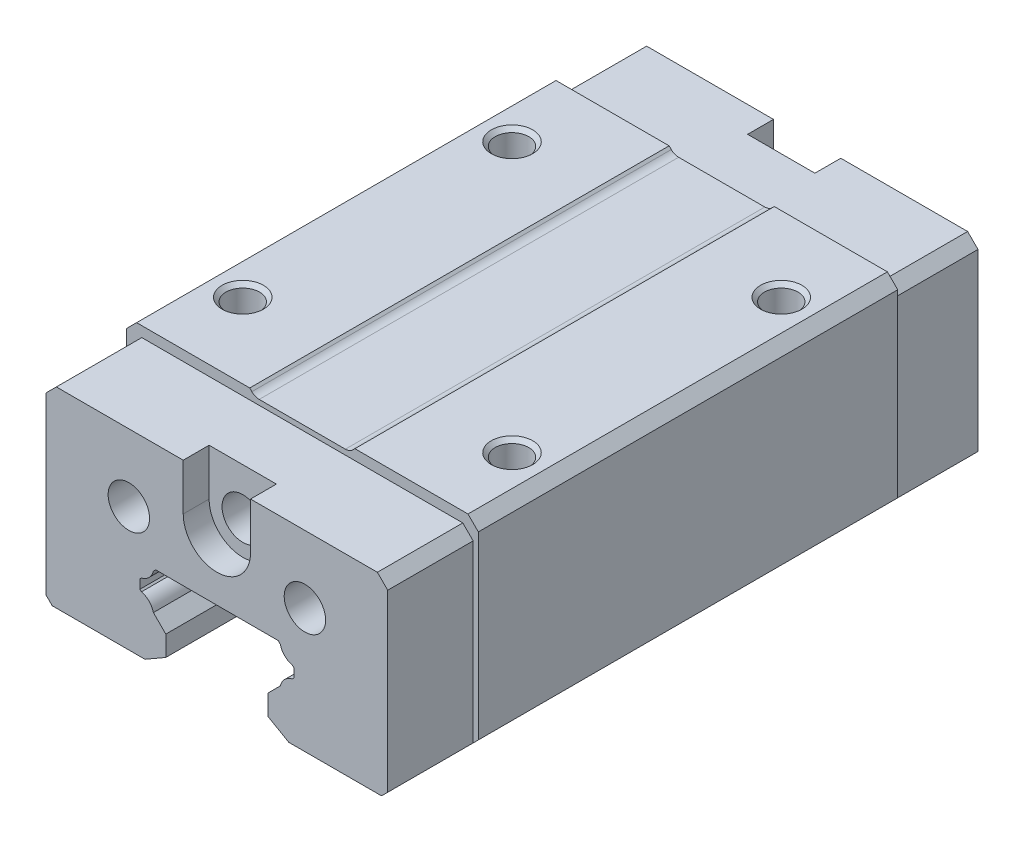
ISO-10303-21;
HEADER;
FILE_DESCRIPTION(('STEP AP214'),'2;1');
FILE_NAME('part.step','',(''),(''),'','','');
FILE_SCHEMA(('AUTOMOTIVE_DESIGN { 1 0 10303 214 1 1 1 1 }'));
ENDSEC;
DATA;
#1=APPLICATION_CONTEXT('core data for automotive mechanical design processes');
#2=APPLICATION_PROTOCOL_DEFINITION('international standard','automotive_design',2000,#1);
#3=PRODUCT_CONTEXT('',#1,'mechanical');
#4=PRODUCT('Part','Part','',(#3));
#5=PRODUCT_RELATED_PRODUCT_CATEGORY('part','',(#4));
#6=PRODUCT_DEFINITION_FORMATION('','',#4);
#7=PRODUCT_DEFINITION_CONTEXT('part definition',#1,'design');
#8=PRODUCT_DEFINITION('design','',#6,#7);
#9=PRODUCT_DEFINITION_SHAPE('','',#8);
#10=(LENGTH_UNIT() NAMED_UNIT(*) SI_UNIT(.MILLI.,.METRE.));
#11=(NAMED_UNIT(*) PLANE_ANGLE_UNIT() SI_UNIT($,.RADIAN.));
#12=(NAMED_UNIT(*) SI_UNIT($,.STERADIAN.) SOLID_ANGLE_UNIT());
#13=UNCERTAINTY_MEASURE_WITH_UNIT(LENGTH_MEASURE(1.E-05),#10,'distance_accuracy_value','');
#14=(GEOMETRIC_REPRESENTATION_CONTEXT(3) GLOBAL_UNCERTAINTY_ASSIGNED_CONTEXT((#13)) GLOBAL_UNIT_ASSIGNED_CONTEXT((#10,
#11,#12)) REPRESENTATION_CONTEXT('',''));
#15=CARTESIAN_POINT('',(0.,0.,0.));
#16=DIRECTION('',(0.,0.,1.));
#17=DIRECTION('',(1.,0.,0.));
#18=AXIS2_PLACEMENT_3D('',#15,#16,#17);
#19=CARTESIAN_POINT('',(-7.4299994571,-13.8860808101,-57.));
#20=DIRECTION('',(1.,0.,0.));
#21=DIRECTION('',(0.,0.,-1.));
#22=AXIS2_PLACEMENT_3D('',#19,#20,#21);
#23=PLANE('',#22);
#24=DIRECTION('',(0.,1.,0.));
#25=VECTOR('',#24,1.);
#26=CARTESIAN_POINT('',(-7.4299994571,-13.8860808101,-57.));
#27=LINE('',#26,#25);
#28=CARTESIAN_POINT('',(-7.4299994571,-13.8860808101,-57.));
#29=VERTEX_POINT('',#28);
#30=CARTESIAN_POINT('',(-7.4299994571,-13.0139191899,-57.));
#31=VERTEX_POINT('',#30);
#32=EDGE_CURVE('E541',#29,#31,#27,.T.);
#33=ORIENTED_EDGE('',*,*,#32,.T.);
#34=DIRECTION('',(0.,0.,1.));
#35=VECTOR('',#34,1.);
#36=CARTESIAN_POINT('',(-7.4299994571,-13.0139191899,-57.));
#37=LINE('',#36,#35);
#38=CARTESIAN_POINT('',(-7.4299994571,-13.0139191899,0.));
#39=VERTEX_POINT('',#38);
#40=EDGE_CURVE('E490',#39,#31,#37,.F.);
#41=ORIENTED_EDGE('',*,*,#40,.F.);
#42=DIRECTION('',(0.,1.,0.));
#43=VECTOR('',#42,1.);
#44=CARTESIAN_POINT('',(-7.4299994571,-13.8860808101,0.));
#45=LINE('',#44,#43);
#46=CARTESIAN_POINT('',(-7.4299994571,-13.8860808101,0.));
#47=VERTEX_POINT('',#46);
#48=EDGE_CURVE('E579',#39,#47,#45,.F.);
#49=ORIENTED_EDGE('',*,*,#48,.T.);
#50=DIRECTION('',(0.,0.,1.));
#51=VECTOR('',#50,1.);
#52=CARTESIAN_POINT('',(-7.4299994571,-13.8860808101,-57.));
#53=LINE('',#52,#51);
#54=EDGE_CURVE('E491',#29,#47,#53,.T.);
#55=ORIENTED_EDGE('',*,*,#54,.F.);
#56=EDGE_LOOP('',(#33,#41,#49,#55));
#57=FACE_BOUND('',#56,.T.);
#58=ADVANCED_FACE('F16',(#57),#23,.T.);
#59=CARTESIAN_POINT('',(7.42999904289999,-13.0139191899,-57.));
#60=DIRECTION('',(-1.,0.,0.));
#61=DIRECTION('',(0.,0.,1.));
#62=AXIS2_PLACEMENT_3D('',#59,#60,#61);
#63=PLANE('',#62);
#64=DIRECTION('',(0.,1.,0.));
#65=VECTOR('',#64,1.);
#66=CARTESIAN_POINT('',(7.42999904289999,-13.0139191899,-57.));
#67=LINE('',#66,#65);
#68=CARTESIAN_POINT('',(7.42999904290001,-13.0139191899,-57.));
#69=VERTEX_POINT('',#68);
#70=CARTESIAN_POINT('',(7.42999904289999,-13.8860808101,-57.));
#71=VERTEX_POINT('',#70);
#72=EDGE_CURVE('E509',#69,#71,#67,.F.);
#73=ORIENTED_EDGE('',*,*,#72,.T.);
#74=DIRECTION('',(0.,0.,1.));
#75=VECTOR('',#74,1.);
#76=CARTESIAN_POINT('',(7.42999904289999,-13.8860808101,-57.));
#77=LINE('',#76,#75);
#78=CARTESIAN_POINT('',(7.42999904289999,-13.8860808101,0.));
#79=VERTEX_POINT('',#78);
#80=EDGE_CURVE('E454',#79,#71,#77,.F.);
#81=ORIENTED_EDGE('',*,*,#80,.F.);
#82=DIRECTION('',(0.,1.,0.));
#83=VECTOR('',#82,1.);
#84=CARTESIAN_POINT('',(7.42999904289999,-13.0139191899,0.));
#85=LINE('',#84,#83);
#86=CARTESIAN_POINT('',(7.42999904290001,-13.0139191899,0.));
#87=VERTEX_POINT('',#86);
#88=EDGE_CURVE('E536',#79,#87,#85,.T.);
#89=ORIENTED_EDGE('',*,*,#88,.T.);
#90=DIRECTION('',(0.,0.,1.));
#91=VECTOR('',#90,1.);
#92=CARTESIAN_POINT('',(7.42999904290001,-13.0139191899,-57.));
#93=LINE('',#92,#91);
#94=EDGE_CURVE('E455',#69,#87,#93,.T.);
#95=ORIENTED_EDGE('',*,*,#94,.F.);
#96=EDGE_LOOP('',(#73,#81,#89,#95));
#97=FACE_BOUND('',#96,.T.);
#98=ADVANCED_FACE('F1190',(#97),#63,.T.);
#99=CARTESIAN_POINT('',(5.54731002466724E-07,-5.5,-48.5));
#100=DIRECTION('',(0.,0.,1.));
#101=DIRECTION('',(1.,0.,0.));
#102=AXIS2_PLACEMENT_3D('',#99,#100,#101);
#103=PLANE('',#102);
#104=CARTESIAN_POINT('',(5.54731002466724E-07,-5.5,-48.5));
#105=DIRECTION('',(0.,0.,1.));
#106=DIRECTION('',(1.,0.,0.));
#107=AXIS2_PLACEMENT_3D('',#104,#105,#106);
#108=CIRCLE('',#107,2.);
#109=CARTESIAN_POINT('',(2.000000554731,-5.5,-48.5));
#110=VERTEX_POINT('',#109);
#111=EDGE_CURVE('E19',#110,#110,#108,.F.);
#112=ORIENTED_EDGE('',*,*,#111,.T.);
#113=EDGE_LOOP('',(#112));
#114=FACE_BOUND('',#113,.T.);
#115=ADVANCED_FACE('F1455',(#114),#103,.F.);
#116=CARTESIAN_POINT('',(5.54731002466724E-07,-5.5,-8.5));
#117=DIRECTION('',(0.,0.,1.));
#118=DIRECTION('',(1.,0.,0.));
#119=AXIS2_PLACEMENT_3D('',#116,#117,#118);
#120=PLANE('',#119);
#121=CARTESIAN_POINT('',(5.54731002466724E-07,-5.5,-8.5));
#122=DIRECTION('',(0.,0.,-1.));
#123=DIRECTION('',(-1.,0.,0.));
#124=AXIS2_PLACEMENT_3D('',#121,#122,#123);
#125=CIRCLE('',#124,2.);
#126=CARTESIAN_POINT('',(-1.999999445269,-5.5,-8.5));
#127=VERTEX_POINT('',#126);
#128=EDGE_CURVE('E424',#127,#127,#125,.F.);
#129=ORIENTED_EDGE('',*,*,#128,.T.);
#130=EDGE_LOOP('',(#129));
#131=FACE_BOUND('',#130,.T.);
#132=ADVANCED_FACE('F1448',(#131),#120,.T.);
#133=CARTESIAN_POINT('',(13.,-6.00000000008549,-15.5));
#134=DIRECTION('',(0.,1.,0.));
#135=DIRECTION('',(-1.,0.,0.));
#136=AXIS2_PLACEMENT_3D('',#133,#134,#135);
#137=CONICAL_SURFACE('',#136,1.62099999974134,1.04719755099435);
#138=CARTESIAN_POINT('',(13.,-6.93588478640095,-15.5000000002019));
#139=VERTEX_POINT('',#138);
#140=VERTEX_LOOP('',#139);
#141=FACE_BOUND('',#140,.T.);
#142=CARTESIAN_POINT('',(13.,-6.,-15.5));
#143=DIRECTION('',(0.,1.,0.));
#144=DIRECTION('',(0.,0.,1.));
#145=AXIS2_PLACEMENT_3D('',#142,#143,#144);
#146=CIRCLE('',#145,1.621);
#147=CARTESIAN_POINT('',(13.,-6.,-13.879));
#148=VERTEX_POINT('',#147);
#149=EDGE_CURVE('E426',#148,#148,#146,.T.);
#150=ORIENTED_EDGE('',*,*,#149,.T.);
#151=EDGE_LOOP('',(#150));
#152=FACE_BOUND('',#151,.T.);
#153=ADVANCED_FACE('F1437',(#141,#152),#137,.F.);
#154=CARTESIAN_POINT('',(13.,-6.00000000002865,-41.5));
#155=DIRECTION('',(0.,1.,0.));
#156=DIRECTION('',(0.,0.,1.));
#157=AXIS2_PLACEMENT_3D('',#154,#155,#156);
#158=CONICAL_SURFACE('',#157,1.62099999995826,1.04719755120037);
#159=CARTESIAN_POINT('',(13.,-6.9358847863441,-41.499999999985));
#160=VERTEX_POINT('',#159);
#161=VERTEX_LOOP('',#160);
#162=FACE_BOUND('',#161,.T.);
#163=CARTESIAN_POINT('',(13.,-6.,-41.5));
#164=DIRECTION('',(0.,1.,0.));
#165=DIRECTION('',(0.,0.,1.));
#166=AXIS2_PLACEMENT_3D('',#163,#164,#165);
#167=CIRCLE('',#166,1.621);
#168=CARTESIAN_POINT('',(13.,-6.,-39.879));
#169=VERTEX_POINT('',#168);
#170=EDGE_CURVE('E430',#169,#169,#167,.T.);
#171=ORIENTED_EDGE('',*,*,#170,.T.);
#172=EDGE_LOOP('',(#171));
#173=FACE_BOUND('',#172,.T.);
#174=ADVANCED_FACE('F1434',(#162,#173),#158,.F.);
#175=CARTESIAN_POINT('',(-13.,-6.00000000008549,-15.5));
#176=DIRECTION('',(0.,1.,0.));
#177=DIRECTION('',(-1.,0.,0.));
#178=AXIS2_PLACEMENT_3D('',#175,#176,#177);
#179=CONICAL_SURFACE('',#178,1.62099999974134,1.04719755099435);
#180=CARTESIAN_POINT('',(-13.,-6.93588478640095,-15.5000000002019));
#181=VERTEX_POINT('',#180);
#182=VERTEX_LOOP('',#181);
#183=FACE_BOUND('',#182,.T.);
#184=CARTESIAN_POINT('',(-13.,-6.,-15.5));
#185=DIRECTION('',(0.,1.,0.));
#186=DIRECTION('',(0.,0.,1.));
#187=AXIS2_PLACEMENT_3D('',#184,#185,#186);
#188=CIRCLE('',#187,1.621);
#189=CARTESIAN_POINT('',(-13.,-6.,-13.879));
#190=VERTEX_POINT('',#189);
#191=EDGE_CURVE('E775',#190,#190,#188,.T.);
#192=ORIENTED_EDGE('',*,*,#191,.T.);
#193=EDGE_LOOP('',(#192));
#194=FACE_BOUND('',#193,.T.);
#195=ADVANCED_FACE('F1436',(#183,#194),#179,.F.);
#196=CARTESIAN_POINT('',(-13.,-6.00000000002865,-41.5));
#197=DIRECTION('',(0.,1.,0.));
#198=DIRECTION('',(0.,0.,1.));
#199=AXIS2_PLACEMENT_3D('',#196,#197,#198);
#200=CONICAL_SURFACE('',#199,1.62099999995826,1.04719755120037);
#201=CARTESIAN_POINT('',(-13.,-6.9358847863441,-41.499999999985));
#202=VERTEX_POINT('',#201);
#203=VERTEX_LOOP('',#202);
#204=FACE_BOUND('',#203,.T.);
#205=CARTESIAN_POINT('',(-13.,-6.,-41.5));
#206=DIRECTION('',(0.,1.,0.));
#207=DIRECTION('',(0.,0.,1.));
#208=AXIS2_PLACEMENT_3D('',#205,#206,#207);
#209=CIRCLE('',#208,1.621);
#210=CARTESIAN_POINT('',(-13.,-6.,-39.879));
#211=VERTEX_POINT('',#210);
#212=EDGE_CURVE('E423',#211,#211,#209,.T.);
#213=ORIENTED_EDGE('',*,*,#212,.T.);
#214=EDGE_LOOP('',(#213));
#215=FACE_BOUND('',#214,.T.);
#216=ADVANCED_FACE('F1445',(#204,#215),#200,.F.);
#217=CARTESIAN_POINT('',(-8.49999944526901,-7.5,-8.5));
#218=DIRECTION('',(0.,0.,1.));
#219=DIRECTION('',(1.,0.,0.));
#220=AXIS2_PLACEMENT_3D('',#217,#218,#219);
#221=PLANE('',#220);
#222=CARTESIAN_POINT('',(-8.49999944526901,-7.5,-8.5));
#223=DIRECTION('',(0.,0.,-1.));
#224=DIRECTION('',(-1.,0.,0.));
#225=AXIS2_PLACEMENT_3D('',#222,#223,#224);
#226=CIRCLE('',#225,2.);
#227=CARTESIAN_POINT('',(-10.499999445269,-7.5,-8.5));
#228=VERTEX_POINT('',#227);
#229=EDGE_CURVE('E421',#228,#228,#226,.F.);
#230=ORIENTED_EDGE('',*,*,#229,.T.);
#231=EDGE_LOOP('',(#230));
#232=FACE_BOUND('',#231,.T.);
#233=ADVANCED_FACE('F1482',(#232),#221,.T.);
#234=CARTESIAN_POINT('',(8.49999905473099,-7.5,-8.5));
#235=DIRECTION('',(0.,0.,1.));
#236=DIRECTION('',(1.,0.,0.));
#237=AXIS2_PLACEMENT_3D('',#234,#235,#236);
#238=PLANE('',#237);
#239=CARTESIAN_POINT('',(8.49999905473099,-7.5,-8.5));
#240=DIRECTION('',(0.,0.,-1.));
#241=DIRECTION('',(-1.,0.,0.));
#242=AXIS2_PLACEMENT_3D('',#239,#240,#241);
#243=CIRCLE('',#242,2.);
#244=CARTESIAN_POINT('',(6.49999905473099,-7.5,-8.5));
#245=VERTEX_POINT('',#244);
#246=EDGE_CURVE('E418',#245,#245,#243,.F.);
#247=ORIENTED_EDGE('',*,*,#246,.T.);
#248=EDGE_LOOP('',(#247));
#249=FACE_BOUND('',#248,.T.);
#250=ADVANCED_FACE('F1492',(#249),#238,.T.);
#251=CARTESIAN_POINT('',(8.49999905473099,-7.5,-48.5));
#252=DIRECTION('',(0.,0.,1.));
#253=DIRECTION('',(1.,0.,0.));
#254=AXIS2_PLACEMENT_3D('',#251,#252,#253);
#255=PLANE('',#254);
#256=CARTESIAN_POINT('',(8.49999905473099,-7.5,-48.5));
#257=DIRECTION('',(0.,0.,1.));
#258=DIRECTION('',(1.,0.,0.));
#259=AXIS2_PLACEMENT_3D('',#256,#257,#258);
#260=CIRCLE('',#259,2.);
#261=CARTESIAN_POINT('',(10.499999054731,-7.5,-48.5));
#262=VERTEX_POINT('',#261);
#263=EDGE_CURVE('E414',#262,#262,#260,.F.);
#264=ORIENTED_EDGE('',*,*,#263,.T.);
#265=EDGE_LOOP('',(#264));
#266=FACE_BOUND('',#265,.T.);
#267=ADVANCED_FACE('F1502',(#266),#255,.F.);
#268=CARTESIAN_POINT('',(-4.9299994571,-16.3860808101,-57.));
#269=DIRECTION('',(0.707106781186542,0.707106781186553,0.));
#270=DIRECTION('',(-0.707106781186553,0.707106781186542,0.));
#271=AXIS2_PLACEMENT_3D('',#268,#269,#270);
#272=PLANE('',#271);
#273=DIRECTION('',(-0.707106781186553,0.707106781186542,0.));
#274=VECTOR('',#273,1.);
#275=CARTESIAN_POINT('',(-4.9299994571,-16.3860808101,-57.));
#276=LINE('',#275,#274);
#277=CARTESIAN_POINT('',(-4.9299994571,-16.3860808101,-57.));
#278=VERTEX_POINT('',#277);
#279=CARTESIAN_POINT('',(-6.13058814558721,-15.1854921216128,-57.));
#280=VERTEX_POINT('',#279);
#281=EDGE_CURVE('E504',#278,#280,#276,.T.);
#282=ORIENTED_EDGE('',*,*,#281,.T.);
#283=DIRECTION('',(0.,0.,-1.));
#284=VECTOR('',#283,1.);
#285=CARTESIAN_POINT('',(-6.13058814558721,-15.1854921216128,-57.));
#286=LINE('',#285,#284);
#287=CARTESIAN_POINT('',(-6.13058814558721,-15.1854921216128,0.));
#288=VERTEX_POINT('',#287);
#289=EDGE_CURVE('E740',#288,#280,#286,.T.);
#290=ORIENTED_EDGE('',*,*,#289,.F.);
#291=DIRECTION('',(-0.707106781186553,0.707106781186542,0.));
#292=VECTOR('',#291,1.);
#293=CARTESIAN_POINT('',(-4.9299994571,-16.3860808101,0.));
#294=LINE('',#293,#292);
#295=CARTESIAN_POINT('',(-4.9299994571,-16.3860808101,0.));
#296=VERTEX_POINT('',#295);
#297=EDGE_CURVE('E507',#288,#296,#294,.F.);
#298=ORIENTED_EDGE('',*,*,#297,.T.);
#299=DIRECTION('',(0.,0.,-1.));
#300=VECTOR('',#299,1.);
#301=CARTESIAN_POINT('',(-4.9299994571,-16.3860808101,-57.));
#302=LINE('',#301,#300);
#303=EDGE_CURVE('E590',#278,#296,#302,.F.);
#304=ORIENTED_EDGE('',*,*,#303,.F.);
#305=EDGE_LOOP('',(#282,#290,#298,#304));
#306=FACE_BOUND('',#305,.T.);
#307=ADVANCED_FACE('F1233',(#306),#272,.T.);
#308=CARTESIAN_POINT('',(-7.28549157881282,-14.0305886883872,-57.));
#309=DIRECTION('',(0.707106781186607,0.707106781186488,0.));
#310=DIRECTION('',(-0.707106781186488,0.707106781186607,0.));
#311=AXIS2_PLACEMENT_3D('',#308,#309,#310);
#312=PLANE('',#311);
#313=DIRECTION('',(-0.707106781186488,0.707106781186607,0.));
#314=VECTOR('',#313,1.);
#315=CARTESIAN_POINT('',(-7.28549157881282,-14.0305886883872,-57.));
#316=LINE('',#315,#314);
#317=CARTESIAN_POINT('',(-7.28549157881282,-14.0305886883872,-57.));
#318=VERTEX_POINT('',#317);
#319=EDGE_CURVE('E497',#318,#29,#316,.T.);
#320=ORIENTED_EDGE('',*,*,#319,.T.);
#321=ORIENTED_EDGE('',*,*,#54,.T.);
#322=DIRECTION('',(-0.707106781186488,0.707106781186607,0.));
#323=VECTOR('',#322,1.);
#324=CARTESIAN_POINT('',(-7.28549157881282,-14.0305886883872,0.));
#325=LINE('',#324,#323);
#326=CARTESIAN_POINT('',(-7.28549157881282,-14.0305886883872,0.));
#327=VERTEX_POINT('',#326);
#328=EDGE_CURVE('E500',#47,#327,#325,.F.);
#329=ORIENTED_EDGE('',*,*,#328,.T.);
#330=DIRECTION('',(0.,0.,-1.));
#331=VECTOR('',#330,1.);
#332=CARTESIAN_POINT('',(-7.28549157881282,-14.0305886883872,-57.));
#333=LINE('',#332,#331);
#334=EDGE_CURVE('E737',#318,#327,#333,.F.);
#335=ORIENTED_EDGE('',*,*,#334,.F.);
#336=EDGE_LOOP('',(#320,#321,#329,#335));
#337=FACE_BOUND('',#336,.T.);
#338=ADVANCED_FACE('F1224',(#337),#312,.T.);
#339=CARTESIAN_POINT('',(-7.4299994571,-13.0139191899,-57.));
#340=DIRECTION('',(0.707106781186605,-0.70710678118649,0.));
#341=DIRECTION('',(0.70710678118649,0.707106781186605,0.));
#342=AXIS2_PLACEMENT_3D('',#339,#340,#341);
#343=PLANE('',#342);
#344=DIRECTION('',(0.70710678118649,0.707106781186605,0.));
#345=VECTOR('',#344,1.);
#346=CARTESIAN_POINT('',(-7.4299994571,-13.0139191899,-57.));
#347=LINE('',#346,#345);
#348=CARTESIAN_POINT('',(-7.28549157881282,-12.8694113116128,-57.));
#349=VERTEX_POINT('',#348);
#350=EDGE_CURVE('E484',#31,#349,#347,.T.);
#351=ORIENTED_EDGE('',*,*,#350,.T.);
#352=DIRECTION('',(0.,0.,-1.));
#353=VECTOR('',#352,1.);
#354=CARTESIAN_POINT('',(-7.28549157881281,-12.8694113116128,-57.));
#355=LINE('',#354,#353);
#356=CARTESIAN_POINT('',(-7.28549157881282,-12.8694113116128,0.));
#357=VERTEX_POINT('',#356);
#358=EDGE_CURVE('E734',#357,#349,#355,.T.);
#359=ORIENTED_EDGE('',*,*,#358,.F.);
#360=DIRECTION('',(0.70710678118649,0.707106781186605,0.));
#361=VECTOR('',#360,1.);
#362=CARTESIAN_POINT('',(-7.4299994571,-13.0139191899,0.));
#363=LINE('',#362,#361);
#364=EDGE_CURVE('E487',#357,#39,#363,.F.);
#365=ORIENTED_EDGE('',*,*,#364,.T.);
#366=ORIENTED_EDGE('',*,*,#40,.T.);
#367=EDGE_LOOP('',(#351,#359,#365,#366));
#368=FACE_BOUND('',#367,.T.);
#369=ADVANCED_FACE('F1217',(#368),#343,.T.);
#370=CARTESIAN_POINT('',(-6.13058814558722,-11.7145078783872,-57.));
#371=DIRECTION('',(0.70710678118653,-0.707106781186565,0.));
#372=DIRECTION('',(0.707106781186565,0.70710678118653,0.));
#373=AXIS2_PLACEMENT_3D('',#370,#371,#372);
#374=PLANE('',#373);
#375=DIRECTION('',(0.707106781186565,0.70710678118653,0.));
#376=VECTOR('',#375,1.);
#377=CARTESIAN_POINT('',(-6.13058814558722,-11.7145078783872,-57.));
#378=LINE('',#377,#376);
#379=CARTESIAN_POINT('',(-6.13058814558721,-11.7145078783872,-57.));
#380=VERTEX_POINT('',#379);
#381=CARTESIAN_POINT('',(-5.9160802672,-11.5,-57.));
#382=VERTEX_POINT('',#381);
#383=EDGE_CURVE('E473',#380,#382,#378,.T.);
#384=ORIENTED_EDGE('',*,*,#383,.T.);
#385=DIRECTION('',(0.,0.,-1.));
#386=VECTOR('',#385,1.);
#387=CARTESIAN_POINT('',(-5.9160802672,-11.5,-57.));
#388=LINE('',#387,#386);
#389=CARTESIAN_POINT('',(-5.9160802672,-11.5,0.));
#390=VERTEX_POINT('',#389);
#391=EDGE_CURVE('E552',#390,#382,#388,.T.);
#392=ORIENTED_EDGE('',*,*,#391,.F.);
#393=DIRECTION('',(0.707106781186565,0.70710678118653,0.));
#394=VECTOR('',#393,1.);
#395=CARTESIAN_POINT('',(-6.13058814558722,-11.7145078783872,0.));
#396=LINE('',#395,#394);
#397=CARTESIAN_POINT('',(-6.13058814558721,-11.7145078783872,0.));
#398=VERTEX_POINT('',#397);
#399=EDGE_CURVE('E480',#390,#398,#396,.F.);
#400=ORIENTED_EDGE('',*,*,#399,.T.);
#401=DIRECTION('',(0.,0.,-1.));
#402=VECTOR('',#401,1.);
#403=CARTESIAN_POINT('',(-6.13058814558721,-11.7145078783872,-57.));
#404=LINE('',#403,#402);
#405=EDGE_CURVE('E571',#380,#398,#404,.F.);
#406=ORIENTED_EDGE('',*,*,#405,.F.);
#407=EDGE_LOOP('',(#384,#392,#400,#406));
#408=FACE_BOUND('',#407,.T.);
#409=ADVANCED_FACE('F1211',(#408),#374,.T.);
#410=CARTESIAN_POINT('',(5.91607985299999,-11.5,-57.));
#411=DIRECTION('',(-0.707106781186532,-0.707106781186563,0.));
#412=DIRECTION('',(0.707106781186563,-0.707106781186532,0.));
#413=AXIS2_PLACEMENT_3D('',#410,#411,#412);
#414=PLANE('',#413);
#415=DIRECTION('',(0.707106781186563,-0.707106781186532,0.));
#416=VECTOR('',#415,1.);
#417=CARTESIAN_POINT('',(5.91607985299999,-11.5,-57.));
#418=LINE('',#417,#416);
#419=CARTESIAN_POINT('',(5.91607985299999,-11.5,-57.));
#420=VERTEX_POINT('',#419);
#421=CARTESIAN_POINT('',(6.13058773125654,-11.7145078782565,-57.));
#422=VERTEX_POINT('',#421);
#423=EDGE_CURVE('E468',#420,#422,#418,.T.);
#424=ORIENTED_EDGE('',*,*,#423,.T.);
#425=DIRECTION('',(0.,0.,-1.));
#426=VECTOR('',#425,1.);
#427=CARTESIAN_POINT('',(6.13058773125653,-11.7145078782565,-57.));
#428=LINE('',#427,#426);
#429=CARTESIAN_POINT('',(6.13058773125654,-11.7145078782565,0.));
#430=VERTEX_POINT('',#429);
#431=EDGE_CURVE('E551',#430,#422,#428,.T.);
#432=ORIENTED_EDGE('',*,*,#431,.F.);
#433=DIRECTION('',(0.707106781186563,-0.707106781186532,0.));
#434=VECTOR('',#433,1.);
#435=CARTESIAN_POINT('',(5.91607985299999,-11.5,0.));
#436=LINE('',#435,#434);
#437=CARTESIAN_POINT('',(5.91607985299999,-11.5,0.));
#438=VERTEX_POINT('',#437);
#439=EDGE_CURVE('E471',#430,#438,#436,.F.);
#440=ORIENTED_EDGE('',*,*,#439,.T.);
#441=DIRECTION('',(0.,0.,-1.));
#442=VECTOR('',#441,1.);
#443=CARTESIAN_POINT('',(5.91607985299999,-11.5,-57.));
#444=LINE('',#443,#442);
#445=EDGE_CURVE('E548',#420,#438,#444,.F.);
#446=ORIENTED_EDGE('',*,*,#445,.F.);
#447=EDGE_LOOP('',(#424,#432,#440,#446));
#448=FACE_BOUND('',#447,.T.);
#449=ADVANCED_FACE('F1202',(#448),#414,.T.);
#450=CARTESIAN_POINT('',(7.28549116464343,-12.8694113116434,-57.));
#451=DIRECTION('',(-0.70710678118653,-0.707106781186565,0.));
#452=DIRECTION('',(0.707106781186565,-0.70710678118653,0.));
#453=AXIS2_PLACEMENT_3D('',#450,#451,#452);
#454=PLANE('',#453);
#455=DIRECTION('',(0.707106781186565,-0.70710678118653,0.));
#456=VECTOR('',#455,1.);
#457=CARTESIAN_POINT('',(7.28549116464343,-12.8694113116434,-57.));
#458=LINE('',#457,#456);
#459=CARTESIAN_POINT('',(7.28549116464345,-12.8694113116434,-57.));
#460=VERTEX_POINT('',#459);
#461=EDGE_CURVE('E461',#460,#69,#458,.T.);
#462=ORIENTED_EDGE('',*,*,#461,.T.);
#463=ORIENTED_EDGE('',*,*,#94,.T.);
#464=DIRECTION('',(0.707106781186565,-0.70710678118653,0.));
#465=VECTOR('',#464,1.);
#466=CARTESIAN_POINT('',(7.28549116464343,-12.8694113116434,0.));
#467=LINE('',#466,#465);
#468=CARTESIAN_POINT('',(7.28549116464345,-12.8694113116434,0.));
#469=VERTEX_POINT('',#468);
#470=EDGE_CURVE('E464',#87,#469,#467,.F.);
#471=ORIENTED_EDGE('',*,*,#470,.T.);
#472=DIRECTION('',(0.,0.,-1.));
#473=VECTOR('',#472,1.);
#474=CARTESIAN_POINT('',(7.28549116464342,-12.8694113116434,-57.));
#475=LINE('',#474,#473);
#476=EDGE_CURVE('E727',#460,#469,#475,.F.);
#477=ORIENTED_EDGE('',*,*,#476,.F.);
#478=EDGE_LOOP('',(#462,#463,#471,#477));
#479=FACE_BOUND('',#478,.T.);
#480=ADVANCED_FACE('F1193',(#479),#454,.T.);
#481=CARTESIAN_POINT('',(7.42999904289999,-13.8860808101,-57.));
#482=DIRECTION('',(-0.707106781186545,0.70710678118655,0.));
#483=DIRECTION('',(-0.70710678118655,-0.707106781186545,0.));
#484=AXIS2_PLACEMENT_3D('',#481,#482,#483);
#485=PLANE('',#484);
#486=DIRECTION('',(-0.70710678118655,-0.707106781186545,0.));
#487=VECTOR('',#486,1.);
#488=CARTESIAN_POINT('',(7.42999904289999,-13.8860808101,-57.));
#489=LINE('',#488,#487);
#490=CARTESIAN_POINT('',(7.28549116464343,-14.0305886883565,-57.));
#491=VERTEX_POINT('',#490);
#492=EDGE_CURVE('E442',#71,#491,#489,.T.);
#493=ORIENTED_EDGE('',*,*,#492,.T.);
#494=DIRECTION('',(0.,0.,-1.));
#495=VECTOR('',#494,1.);
#496=CARTESIAN_POINT('',(7.28549116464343,-14.0305886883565,-57.));
#497=LINE('',#496,#495);
#498=CARTESIAN_POINT('',(7.28549116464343,-14.0305886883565,0.));
#499=VERTEX_POINT('',#498);
#500=EDGE_CURVE('E724',#499,#491,#497,.T.);
#501=ORIENTED_EDGE('',*,*,#500,.F.);
#502=DIRECTION('',(-0.70710678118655,-0.707106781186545,0.));
#503=VECTOR('',#502,1.);
#504=CARTESIAN_POINT('',(7.42999904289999,-13.8860808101,0.));
#505=LINE('',#504,#503);
#506=EDGE_CURVE('E451',#499,#79,#505,.F.);
#507=ORIENTED_EDGE('',*,*,#506,.T.);
#508=ORIENTED_EDGE('',*,*,#80,.T.);
#509=EDGE_LOOP('',(#493,#501,#507,#508));
#510=FACE_BOUND('',#509,.T.);
#511=ADVANCED_FACE('F1186',(#510),#485,.T.);
#512=CARTESIAN_POINT('',(6.13058773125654,-15.1854921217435,-57.));
#513=DIRECTION('',(-0.707106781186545,0.70710678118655,0.));
#514=DIRECTION('',(-0.70710678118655,-0.707106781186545,0.));
#515=AXIS2_PLACEMENT_3D('',#512,#513,#514);
#516=PLANE('',#515);
#517=DIRECTION('',(-0.70710678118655,-0.707106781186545,0.));
#518=VECTOR('',#517,1.);
#519=CARTESIAN_POINT('',(6.13058773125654,-15.1854921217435,-57.));
#520=LINE('',#519,#518);
#521=CARTESIAN_POINT('',(6.13058773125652,-15.1854921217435,-57.));
#522=VERTEX_POINT('',#521);
#523=CARTESIAN_POINT('',(4.92999904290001,-16.3860808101,-57.));
#524=VERTEX_POINT('',#523);
#525=EDGE_CURVE('E433',#522,#524,#520,.T.);
#526=ORIENTED_EDGE('',*,*,#525,.T.);
#527=DIRECTION('',(0.,0.,1.));
#528=VECTOR('',#527,1.);
#529=CARTESIAN_POINT('',(4.92999904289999,-16.3860808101,-57.));
#530=LINE('',#529,#528);
#531=CARTESIAN_POINT('',(4.9299990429,-16.3860808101,0.));
#532=VERTEX_POINT('',#531);
#533=EDGE_CURVE('E413',#532,#524,#530,.F.);
#534=ORIENTED_EDGE('',*,*,#533,.F.);
#535=DIRECTION('',(-0.70710678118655,-0.707106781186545,0.));
#536=VECTOR('',#535,1.);
#537=CARTESIAN_POINT('',(6.13058773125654,-15.1854921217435,0.));
#538=LINE('',#537,#536);
#539=CARTESIAN_POINT('',(6.13058773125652,-15.1854921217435,0.));
#540=VERTEX_POINT('',#539);
#541=EDGE_CURVE('E436',#532,#540,#538,.F.);
#542=ORIENTED_EDGE('',*,*,#541,.T.);
#543=DIRECTION('',(0.,0.,-1.));
#544=VECTOR('',#543,1.);
#545=CARTESIAN_POINT('',(6.13058773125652,-15.1854921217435,-57.));
#546=LINE('',#545,#544);
#547=EDGE_CURVE('E516',#522,#540,#546,.F.);
#548=ORIENTED_EDGE('',*,*,#547,.F.);
#549=EDGE_LOOP('',(#526,#534,#542,#548));
#550=FACE_BOUND('',#549,.T.);
#551=ADVANCED_FACE('F1176',(#550),#516,.T.);
#552=CARTESIAN_POINT('',(-8.49999944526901,-7.5,-48.5));
#553=DIRECTION('',(0.,0.,1.));
#554=DIRECTION('',(1.,0.,0.));
#555=AXIS2_PLACEMENT_3D('',#552,#553,#554);
#556=PLANE('',#555);
#557=CARTESIAN_POINT('',(-8.49999944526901,-7.5,-48.5));
#558=DIRECTION('',(0.,0.,1.));
#559=DIRECTION('',(1.,0.,0.));
#560=AXIS2_PLACEMENT_3D('',#557,#558,#559);
#561=CIRCLE('',#560,2.);
#562=CARTESIAN_POINT('',(-6.49999944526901,-7.5,-48.5));
#563=VERTEX_POINT('',#562);
#564=EDGE_CURVE('E389',#563,#563,#561,.F.);
#565=ORIENTED_EDGE('',*,*,#564,.T.);
#566=EDGE_LOOP('',(#565));
#567=FACE_BOUND('',#566,.T.);
#568=ADVANCED_FACE('F1280',(#567),#556,.F.);
#569=CARTESIAN_POINT('',(5.54731002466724E-07,-5.5,-48.5));
#570=DIRECTION('',(0.,0.,1.));
#571=DIRECTION('',(1.,0.,0.));
#572=AXIS2_PLACEMENT_3D('',#569,#570,#571);
#573=CYLINDRICAL_SURFACE('',#572,2.);
#574=CARTESIAN_POINT('',(5.54731002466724E-07,-5.5,-54.5));
#575=DIRECTION('',(0.,0.,1.));
#576=DIRECTION('',(1.,0.,0.));
#577=AXIS2_PLACEMENT_3D('',#574,#575,#576);
#578=CIRCLE('',#577,2.);
#579=CARTESIAN_POINT('',(2.000000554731,-5.5,-54.5));
#580=VERTEX_POINT('',#579);
#581=EDGE_CURVE('E388',#580,#580,#578,.F.);
#582=ORIENTED_EDGE('',*,*,#581,.T.);
#583=EDGE_LOOP('',(#582));
#584=FACE_BOUND('',#583,.T.);
#585=ORIENTED_EDGE('',*,*,#111,.F.);
#586=EDGE_LOOP('',(#585));
#587=FACE_BOUND('',#586,.T.);
#588=ADVANCED_FACE('F1269',(#584,#587),#573,.F.);
#589=CARTESIAN_POINT('',(5.54731002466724E-07,-5.5,-8.5));
#590=DIRECTION('',(0.,0.,-1.));
#591=DIRECTION('',(-1.,0.,0.));
#592=AXIS2_PLACEMENT_3D('',#589,#590,#591);
#593=CYLINDRICAL_SURFACE('',#592,2.);
#594=ORIENTED_EDGE('',*,*,#128,.F.);
#595=EDGE_LOOP('',(#594));
#596=FACE_BOUND('',#595,.T.);
#597=CARTESIAN_POINT('',(5.54731002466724E-07,-5.5,-2.5));
#598=DIRECTION('',(0.,0.,-1.));
#599=DIRECTION('',(-1.,0.,0.));
#600=AXIS2_PLACEMENT_3D('',#597,#598,#599);
#601=CIRCLE('',#600,2.);
#602=CARTESIAN_POINT('',(-1.999999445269,-5.5,-2.5));
#603=VERTEX_POINT('',#602);
#604=EDGE_CURVE('E408',#603,#603,#601,.T.);
#605=ORIENTED_EDGE('',*,*,#604,.F.);
#606=EDGE_LOOP('',(#605));
#607=FACE_BOUND('',#606,.T.);
#608=ADVANCED_FACE('F1266',(#596,#607),#593,.F.);
#609=CARTESIAN_POINT('',(13.,-6.93588478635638,-15.5));
#610=DIRECTION('',(0.,1.,0.));
#611=DIRECTION('',(0.,0.,1.));
#612=AXIS2_PLACEMENT_3D('',#609,#610,#611);
#613=CYLINDRICAL_SURFACE('',#612,1.621);
#614=CARTESIAN_POINT('',(13.,-0.379000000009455,-15.5));
#615=DIRECTION('',(0.,1.,0.));
#616=DIRECTION('',(0.,0.,1.));
#617=AXIS2_PLACEMENT_3D('',#614,#615,#616);
#618=CIRCLE('',#617,1.62099999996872);
#619=CARTESIAN_POINT('',(13.,-0.379000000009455,-13.8790000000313));
#620=VERTEX_POINT('',#619);
#621=EDGE_CURVE('E818',#620,#620,#618,.T.);
#622=ORIENTED_EDGE('',*,*,#621,.T.);
#623=EDGE_LOOP('',(#622));
#624=FACE_BOUND('',#623,.T.);
#625=ORIENTED_EDGE('',*,*,#149,.F.);
#626=EDGE_LOOP('',(#625));
#627=FACE_BOUND('',#626,.T.);
#628=ADVANCED_FACE('F1268',(#624,#627),#613,.F.);
#629=CARTESIAN_POINT('',(13.,-6.93588478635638,-41.5));
#630=DIRECTION('',(0.,1.,0.));
#631=DIRECTION('',(0.,0.,1.));
#632=AXIS2_PLACEMENT_3D('',#629,#630,#631);
#633=CYLINDRICAL_SURFACE('',#632,1.621);
#634=CARTESIAN_POINT('',(13.,-0.379000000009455,-41.5));
#635=DIRECTION('',(0.,1.,0.));
#636=DIRECTION('',(0.,0.,1.));
#637=AXIS2_PLACEMENT_3D('',#634,#635,#636);
#638=CIRCLE('',#637,1.62099999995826);
#639=CARTESIAN_POINT('',(13.,-0.379000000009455,-39.8790000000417));
#640=VERTEX_POINT('',#639);
#641=EDGE_CURVE('E678',#640,#640,#638,.T.);
#642=ORIENTED_EDGE('',*,*,#641,.T.);
#643=EDGE_LOOP('',(#642));
#644=FACE_BOUND('',#643,.T.);
#645=ORIENTED_EDGE('',*,*,#170,.F.);
#646=EDGE_LOOP('',(#645));
#647=FACE_BOUND('',#646,.T.);
#648=ADVANCED_FACE('F1278',(#644,#647),#633,.F.);
#649=CARTESIAN_POINT('',(-13.,-6.93588478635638,-15.5));
#650=DIRECTION('',(0.,1.,0.));
#651=DIRECTION('',(0.,0.,1.));
#652=AXIS2_PLACEMENT_3D('',#649,#650,#651);
#653=CYLINDRICAL_SURFACE('',#652,1.621);
#654=CARTESIAN_POINT('',(-13.,-0.379000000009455,-15.5));
#655=DIRECTION('',(0.,1.,0.));
#656=DIRECTION('',(0.,0.,1.));
#657=AXIS2_PLACEMENT_3D('',#654,#655,#656);
#658=CIRCLE('',#657,1.62099999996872);
#659=CARTESIAN_POINT('',(-13.,-0.379000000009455,-13.8790000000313));
#660=VERTEX_POINT('',#659);
#661=EDGE_CURVE('E800',#660,#660,#658,.T.);
#662=ORIENTED_EDGE('',*,*,#661,.T.);
#663=EDGE_LOOP('',(#662));
#664=FACE_BOUND('',#663,.T.);
#665=ORIENTED_EDGE('',*,*,#191,.F.);
#666=EDGE_LOOP('',(#665));
#667=FACE_BOUND('',#666,.T.);
#668=ADVANCED_FACE('F1420',(#664,#667),#653,.F.);
#669=CARTESIAN_POINT('',(-13.,-6.93588478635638,-41.5));
#670=DIRECTION('',(0.,1.,0.));
#671=DIRECTION('',(0.,0.,1.));
#672=AXIS2_PLACEMENT_3D('',#669,#670,#671);
#673=CYLINDRICAL_SURFACE('',#672,1.621);
#674=CARTESIAN_POINT('',(-13.,-0.379000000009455,-41.5));
#675=DIRECTION('',(0.,1.,0.));
#676=DIRECTION('',(0.,0.,1.));
#677=AXIS2_PLACEMENT_3D('',#674,#675,#676);
#678=CIRCLE('',#677,1.62099999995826);
#679=CARTESIAN_POINT('',(-13.,-0.379000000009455,-39.8790000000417));
#680=VERTEX_POINT('',#679);
#681=EDGE_CURVE('E781',#680,#680,#678,.T.);
#682=ORIENTED_EDGE('',*,*,#681,.T.);
#683=EDGE_LOOP('',(#682));
#684=FACE_BOUND('',#683,.T.);
#685=ORIENTED_EDGE('',*,*,#212,.F.);
#686=EDGE_LOOP('',(#685));
#687=FACE_BOUND('',#686,.T.);
#688=ADVANCED_FACE('F1416',(#684,#687),#673,.F.);
#689=CARTESIAN_POINT('',(-8.49999944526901,-7.5,-8.5));
#690=DIRECTION('',(0.,0.,-1.));
#691=DIRECTION('',(-1.,0.,0.));
#692=AXIS2_PLACEMENT_3D('',#689,#690,#691);
#693=CYLINDRICAL_SURFACE('',#692,2.);
#694=CARTESIAN_POINT('',(-8.49999944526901,-7.5,0.));
#695=DIRECTION('',(0.,0.,-1.));
#696=DIRECTION('',(-1.,0.,0.));
#697=AXIS2_PLACEMENT_3D('',#694,#695,#696);
#698=CIRCLE('',#697,2.);
#699=CARTESIAN_POINT('',(-10.499999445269,-7.5,0.));
#700=VERTEX_POINT('',#699);
#701=EDGE_CURVE('E666',#700,#700,#698,.T.);
#702=ORIENTED_EDGE('',*,*,#701,.F.);
#703=EDGE_LOOP('',(#702));
#704=FACE_BOUND('',#703,.T.);
#705=ORIENTED_EDGE('',*,*,#229,.F.);
#706=EDGE_LOOP('',(#705));
#707=FACE_BOUND('',#706,.T.);
#708=ADVANCED_FACE('F1412',(#704,#707),#693,.F.);
#709=CARTESIAN_POINT('',(8.49999905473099,-7.5,-8.5));
#710=DIRECTION('',(0.,0.,-1.));
#711=DIRECTION('',(-1.,0.,0.));
#712=AXIS2_PLACEMENT_3D('',#709,#710,#711);
#713=CYLINDRICAL_SURFACE('',#712,2.);
#714=CARTESIAN_POINT('',(8.49999905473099,-7.5,0.));
#715=DIRECTION('',(0.,0.,-1.));
#716=DIRECTION('',(-1.,0.,0.));
#717=AXIS2_PLACEMENT_3D('',#714,#715,#716);
#718=CIRCLE('',#717,2.);
#719=CARTESIAN_POINT('',(6.49999905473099,-7.5,0.));
#720=VERTEX_POINT('',#719);
#721=EDGE_CURVE('E662',#720,#720,#718,.T.);
#722=ORIENTED_EDGE('',*,*,#721,.F.);
#723=EDGE_LOOP('',(#722));
#724=FACE_BOUND('',#723,.T.);
#725=ORIENTED_EDGE('',*,*,#246,.F.);
#726=EDGE_LOOP('',(#725));
#727=FACE_BOUND('',#726,.T.);
#728=ADVANCED_FACE('F1409',(#724,#727),#713,.F.);
#729=CARTESIAN_POINT('',(-4.43143008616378E-07,-5.49999999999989,-2.5));
#730=DIRECTION('',(0.,0.,-1.));
#731=DIRECTION('',(-1.,0.,0.));
#732=AXIS2_PLACEMENT_3D('',#729,#730,#731);
#733=CYLINDRICAL_SURFACE('',#732,3.25);
#734=DIRECTION('',(0.,0.,1.));
#735=VECTOR('',#734,1.);
#736=CARTESIAN_POINT('',(3.24999955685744,-5.49999457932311,-2.5));
#737=LINE('',#736,#735);
#738=CARTESIAN_POINT('',(3.24999973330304,-5.4999972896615,0.));
#739=VERTEX_POINT('',#738);
#740=CARTESIAN_POINT('',(3.24999955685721,-5.49999741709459,-2.5));
#741=VERTEX_POINT('',#740);
#742=EDGE_CURVE('E681',#739,#741,#737,.F.);
#743=ORIENTED_EDGE('',*,*,#742,.T.);
#744=CARTESIAN_POINT('',(-4.43143008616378E-07,-5.49999999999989,-2.5));
#745=DIRECTION('',(0.,0.,-1.));
#746=DIRECTION('',(-1.,0.,0.));
#747=AXIS2_PLACEMENT_3D('',#744,#745,#746);
#748=CIRCLE('',#747,3.25);
#749=CARTESIAN_POINT('',(-3.25000025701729,-5.49999986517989,-2.5));
#750=VERTEX_POINT('',#749);
#751=EDGE_CURVE('E679',#750,#741,#748,.F.);
#752=ORIENTED_EDGE('',*,*,#751,.F.);
#753=DIRECTION('',(0.,0.,1.));
#754=VECTOR('',#753,1.);
#755=CARTESIAN_POINT('',(-3.25000044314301,-5.49999973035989,-2.5));
#756=LINE('',#755,#754);
#757=CARTESIAN_POINT('',(-3.25000044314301,-5.49999986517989,0.));
#758=VERTEX_POINT('',#757);
#759=EDGE_CURVE('E692',#750,#758,#756,.T.);
#760=ORIENTED_EDGE('',*,*,#759,.T.);
#761=CARTESIAN_POINT('',(-4.43143008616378E-07,-5.49999999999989,0.));
#762=DIRECTION('',(0.,0.,-1.));
#763=DIRECTION('',(-1.,0.,0.));
#764=AXIS2_PLACEMENT_3D('',#761,#762,#763);
#765=CIRCLE('',#764,3.25);
#766=EDGE_CURVE('E649',#739,#758,#765,.T.);
#767=ORIENTED_EDGE('',*,*,#766,.F.);
#768=EDGE_LOOP('',(#743,#752,#760,#767));
#769=FACE_BOUND('',#768,.T.);
#770=ADVANCED_FACE('F1257',(#769),#733,.F.);
#771=CARTESIAN_POINT('',(8.49999905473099,-7.5,-48.5));
#772=DIRECTION('',(0.,0.,1.));
#773=DIRECTION('',(1.,0.,0.));
#774=AXIS2_PLACEMENT_3D('',#771,#772,#773);
#775=CYLINDRICAL_SURFACE('',#774,2.);
#776=CARTESIAN_POINT('',(8.49999905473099,-7.5,-57.));
#777=DIRECTION('',(0.,0.,1.));
#778=DIRECTION('',(1.,0.,0.));
#779=AXIS2_PLACEMENT_3D('',#776,#777,#778);
#780=CIRCLE('',#779,2.);
#781=CARTESIAN_POINT('',(10.499999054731,-7.5,-57.));
#782=VERTEX_POINT('',#781);
#783=EDGE_CURVE('E644',#782,#782,#780,.F.);
#784=ORIENTED_EDGE('',*,*,#783,.T.);
#785=EDGE_LOOP('',(#784));
#786=FACE_BOUND('',#785,.T.);
#787=ORIENTED_EDGE('',*,*,#263,.F.);
#788=EDGE_LOOP('',(#787));
#789=FACE_BOUND('',#788,.T.);
#790=ADVANCED_FACE('F1403',(#786,#789),#775,.F.);
#791=CARTESIAN_POINT('',(-15.9000002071,-19.5,-57.));
#792=DIRECTION('',(0.,-1.,0.));
#793=DIRECTION('',(0.,0.,-1.));
#794=AXIS2_PLACEMENT_3D('',#791,#792,#793);
#795=PLANE('',#794);
#796=DIRECTION('',(1.,0.,0.));
#797=VECTOR('',#796,1.);
#798=CARTESIAN_POINT('',(-7.6395974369,-19.5,-57.));
#799=LINE('',#798,#797);
#800=CARTESIAN_POINT('',(-15.9000002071,-19.5,-57.));
#801=VERTEX_POINT('',#800);
#802=CARTESIAN_POINT('',(-6.94115373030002,-19.5,-57.));
#803=VERTEX_POINT('',#802);
#804=EDGE_CURVE('E887',#801,#803,#799,.T.);
#805=ORIENTED_EDGE('',*,*,#804,.T.);
#806=DIRECTION('',(0.,0.,1.));
#807=VECTOR('',#806,1.);
#808=CARTESIAN_POINT('',(-6.94115373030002,-19.5,-57.));
#809=LINE('',#808,#807);
#810=CARTESIAN_POINT('',(-6.94115373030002,-19.5,0.));
#811=VERTEX_POINT('',#810);
#812=EDGE_CURVE('E417',#811,#803,#809,.F.);
#813=ORIENTED_EDGE('',*,*,#812,.F.);
#814=DIRECTION('',(1.,0.,0.));
#815=VECTOR('',#814,1.);
#816=CARTESIAN_POINT('',(-7.6395974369,-19.5,0.));
#817=LINE('',#816,#815);
#818=CARTESIAN_POINT('',(-15.9000002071,-19.5,0.));
#819=VERTEX_POINT('',#818);
#820=EDGE_CURVE('E908',#819,#811,#817,.T.);
#821=ORIENTED_EDGE('',*,*,#820,.F.);
#822=DIRECTION('',(0.,0.,1.));
#823=VECTOR('',#822,1.);
#824=CARTESIAN_POINT('',(-15.9000002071,-19.5,-57.));
#825=LINE('',#824,#823);
#826=EDGE_CURVE('E927',#801,#819,#825,.T.);
#827=ORIENTED_EDGE('',*,*,#826,.F.);
#828=EDGE_LOOP('',(#805,#813,#821,#827));
#829=FACE_BOUND('',#828,.T.);
#830=ADVANCED_FACE('F1242',(#829),#795,.T.);
#831=CARTESIAN_POINT('',(-6.94115373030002,-19.5,-57.));
#832=DIRECTION('',(0.499999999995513,-0.866025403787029,0.));
#833=DIRECTION('',(0.866025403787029,0.499999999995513,0.));
#834=AXIS2_PLACEMENT_3D('',#831,#832,#833);
#835=PLANE('',#834);
#836=DIRECTION('',(0.866025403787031,0.499999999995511,0.));
#837=VECTOR('',#836,1.);
#838=CARTESIAN_POINT('',(-6.94115373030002,-19.5,-57.));
#839=LINE('',#838,#837);
#840=CARTESIAN_POINT('',(-4.9299994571,-18.338859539,-57.));
#841=VERTEX_POINT('',#840);
#842=EDGE_CURVE('E600',#803,#841,#839,.T.);
#843=ORIENTED_EDGE('',*,*,#842,.T.);
#844=DIRECTION('',(0.,0.,-1.));
#845=VECTOR('',#844,1.);
#846=CARTESIAN_POINT('',(-4.9299994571,-18.338859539,-57.));
#847=LINE('',#846,#845);
#848=CARTESIAN_POINT('',(-4.9299994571,-18.338859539,0.));
#849=VERTEX_POINT('',#848);
#850=EDGE_CURVE('E593',#849,#841,#847,.T.);
#851=ORIENTED_EDGE('',*,*,#850,.F.);
#852=DIRECTION('',(0.866025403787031,0.499999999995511,0.));
#853=VECTOR('',#852,1.);
#854=CARTESIAN_POINT('',(-6.94115373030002,-19.5,0.));
#855=LINE('',#854,#853);
#856=EDGE_CURVE('E607',#811,#849,#855,.T.);
#857=ORIENTED_EDGE('',*,*,#856,.F.);
#858=ORIENTED_EDGE('',*,*,#812,.T.);
#859=EDGE_LOOP('',(#843,#851,#857,#858));
#860=FACE_BOUND('',#859,.T.);
#861=ADVANCED_FACE('F1239',(#860),#835,.T.);
#862=CARTESIAN_POINT('',(-4.9299994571,-18.338859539,-57.));
#863=DIRECTION('',(1.,0.,0.));
#864=DIRECTION('',(0.,0.,-1.));
#865=AXIS2_PLACEMENT_3D('',#862,#863,#864);
#866=PLANE('',#865);
#867=DIRECTION('',(0.,1.,0.));
#868=VECTOR('',#867,1.);
#869=CARTESIAN_POINT('',(-4.9299994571,-15.5395979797,0.));
#870=LINE('',#869,#868);
#871=EDGE_CURVE('E603',#849,#296,#870,.T.);
#872=ORIENTED_EDGE('',*,*,#871,.F.);
#873=ORIENTED_EDGE('',*,*,#850,.T.);
#874=DIRECTION('',(0.,1.,0.));
#875=VECTOR('',#874,1.);
#876=CARTESIAN_POINT('',(-4.9299994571,-15.5395979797,-57.));
#877=LINE('',#876,#875);
#878=EDGE_CURVE('E596',#841,#278,#877,.T.);
#879=ORIENTED_EDGE('',*,*,#878,.T.);
#880=ORIENTED_EDGE('',*,*,#303,.T.);
#881=EDGE_LOOP('',(#872,#873,#879,#880));
#882=FACE_BOUND('',#881,.T.);
#883=ADVANCED_FACE('F1236',(#882),#866,.T.);
#884=CARTESIAN_POINT('',(-7.6395974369,-15.5395979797,-57.));
#885=DIRECTION('',(0.,0.,-1.));
#886=DIRECTION('',(-1.,0.,0.));
#887=AXIS2_PLACEMENT_3D('',#884,#885,#886);
#888=CYLINDRICAL_SURFACE('',#887,1.55);
#889=CARTESIAN_POINT('',(-7.6395974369,-15.5395979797,-57.));
#890=DIRECTION('',(0.,0.,-1.));
#891=DIRECTION('',(-1.,0.,0.));
#892=AXIS2_PLACEMENT_3D('',#889,#890,#891);
#893=CIRCLE('',#892,1.55);
#894=EDGE_CURVE('E599',#280,#318,#893,.F.);
#895=ORIENTED_EDGE('',*,*,#894,.T.);
#896=ORIENTED_EDGE('',*,*,#334,.T.);
#897=CARTESIAN_POINT('',(-7.6395974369,-15.5395979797,0.));
#898=DIRECTION('',(0.,0.,-1.));
#899=DIRECTION('',(-1.,0.,0.));
#900=AXIS2_PLACEMENT_3D('',#897,#898,#899);
#901=CIRCLE('',#900,1.55);
#902=EDGE_CURVE('E606',#288,#327,#901,.F.);
#903=ORIENTED_EDGE('',*,*,#902,.F.);
#904=ORIENTED_EDGE('',*,*,#289,.T.);
#905=EDGE_LOOP('',(#895,#896,#903,#904));
#906=FACE_BOUND('',#905,.T.);
#907=ADVANCED_FACE('F1227',(#906),#888,.T.);
#908=CARTESIAN_POINT('',(-7.6395974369,-11.3604020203,-57.));
#909=DIRECTION('',(0.,0.,-1.));
#910=DIRECTION('',(-1.,0.,0.));
#911=AXIS2_PLACEMENT_3D('',#908,#909,#910);
#912=CYLINDRICAL_SURFACE('',#911,1.55);
#913=CARTESIAN_POINT('',(-7.6395974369,-11.3604020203,-57.));
#914=DIRECTION('',(0.,0.,-1.));
#915=DIRECTION('',(-1.,0.,0.));
#916=AXIS2_PLACEMENT_3D('',#913,#914,#915);
#917=CIRCLE('',#916,1.55);
#918=EDGE_CURVE('E559',#349,#380,#917,.F.);
#919=ORIENTED_EDGE('',*,*,#918,.T.);
#920=ORIENTED_EDGE('',*,*,#405,.T.);
#921=CARTESIAN_POINT('',(-7.6395974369,-11.3604020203,0.));
#922=DIRECTION('',(0.,0.,-1.));
#923=DIRECTION('',(-1.,0.,0.));
#924=AXIS2_PLACEMENT_3D('',#921,#922,#923);
#925=CIRCLE('',#924,1.55);
#926=EDGE_CURVE('E566',#357,#398,#925,.F.);
#927=ORIENTED_EDGE('',*,*,#926,.F.);
#928=ORIENTED_EDGE('',*,*,#358,.T.);
#929=EDGE_LOOP('',(#919,#920,#927,#928));
#930=FACE_BOUND('',#929,.T.);
#931=ADVANCED_FACE('F1214',(#930),#912,.T.);
#932=CARTESIAN_POINT('',(-5.9160802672,-11.5,-57.));
#933=DIRECTION('',(0.,-1.,0.));
#934=DIRECTION('',(0.,0.,-1.));
#935=AXIS2_PLACEMENT_3D('',#932,#933,#934);
#936=PLANE('',#935);
#937=DIRECTION('',(1.,0.,0.));
#938=VECTOR('',#937,1.);
#939=CARTESIAN_POINT('',(-7.6395974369,-11.5,-57.));
#940=LINE('',#939,#938);
#941=EDGE_CURVE('E555',#382,#420,#940,.T.);
#942=ORIENTED_EDGE('',*,*,#941,.T.);
#943=ORIENTED_EDGE('',*,*,#445,.T.);
#944=DIRECTION('',(1.,0.,0.));
#945=VECTOR('',#944,1.);
#946=CARTESIAN_POINT('',(-7.6395974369,-11.5,0.));
#947=LINE('',#946,#945);
#948=EDGE_CURVE('E562',#390,#438,#947,.T.);
#949=ORIENTED_EDGE('',*,*,#948,.F.);
#950=ORIENTED_EDGE('',*,*,#391,.T.);
#951=EDGE_LOOP('',(#942,#943,#949,#950));
#952=FACE_BOUND('',#951,.T.);
#953=ADVANCED_FACE('F1205',(#952),#936,.T.);
#954=CARTESIAN_POINT('',(7.63959702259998,-11.3604020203,-57.));
#955=DIRECTION('',(0.,0.,-1.));
#956=DIRECTION('',(-1.,0.,0.));
#957=AXIS2_PLACEMENT_3D('',#954,#955,#956);
#958=CYLINDRICAL_SURFACE('',#957,1.55);
#959=CARTESIAN_POINT('',(7.63959702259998,-11.3604020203,-57.));
#960=DIRECTION('',(0.,0.,-1.));
#961=DIRECTION('',(-1.,0.,0.));
#962=AXIS2_PLACEMENT_3D('',#959,#960,#961);
#963=CIRCLE('',#962,1.55);
#964=EDGE_CURVE('E558',#422,#460,#963,.F.);
#965=ORIENTED_EDGE('',*,*,#964,.T.);
#966=ORIENTED_EDGE('',*,*,#476,.T.);
#967=CARTESIAN_POINT('',(7.63959702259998,-11.3604020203,0.));
#968=DIRECTION('',(0.,0.,-1.));
#969=DIRECTION('',(-1.,0.,0.));
#970=AXIS2_PLACEMENT_3D('',#967,#968,#969);
#971=CIRCLE('',#970,1.55);
#972=EDGE_CURVE('E565',#430,#469,#971,.F.);
#973=ORIENTED_EDGE('',*,*,#972,.F.);
#974=ORIENTED_EDGE('',*,*,#431,.T.);
#975=EDGE_LOOP('',(#965,#966,#973,#974));
#976=FACE_BOUND('',#975,.T.);
#977=ADVANCED_FACE('F1198',(#976),#958,.T.);
#978=CARTESIAN_POINT('',(7.63959702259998,-15.5395979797,-57.));
#979=DIRECTION('',(0.,0.,-1.));
#980=DIRECTION('',(-1.,0.,0.));
#981=AXIS2_PLACEMENT_3D('',#978,#979,#980);
#982=CYLINDRICAL_SURFACE('',#981,1.55);
#983=CARTESIAN_POINT('',(7.63959702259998,-15.5395979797,-57.));
#984=DIRECTION('',(0.,0.,-1.));
#985=DIRECTION('',(-1.,0.,0.));
#986=AXIS2_PLACEMENT_3D('',#983,#984,#985);
#987=CIRCLE('',#986,1.55);
#988=EDGE_CURVE('E522',#491,#522,#987,.F.);
#989=ORIENTED_EDGE('',*,*,#988,.T.);
#990=ORIENTED_EDGE('',*,*,#547,.T.);
#991=CARTESIAN_POINT('',(7.63959702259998,-15.5395979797,0.));
#992=DIRECTION('',(0.,0.,-1.));
#993=DIRECTION('',(-1.,0.,0.));
#994=AXIS2_PLACEMENT_3D('',#991,#992,#993);
#995=CIRCLE('',#994,1.55);
#996=EDGE_CURVE('E528',#499,#540,#995,.F.);
#997=ORIENTED_EDGE('',*,*,#996,.F.);
#998=ORIENTED_EDGE('',*,*,#500,.T.);
#999=EDGE_LOOP('',(#989,#990,#997,#998));
#1000=FACE_BOUND('',#999,.T.);
#1001=ADVANCED_FACE('F1180',(#1000),#982,.T.);
#1002=CARTESIAN_POINT('',(4.92999904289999,-16.3860808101,-57.));
#1003=DIRECTION('',(-1.,0.,0.));
#1004=DIRECTION('',(0.,0.,1.));
#1005=AXIS2_PLACEMENT_3D('',#1002,#1003,#1004);
#1006=PLANE('',#1005);
#1007=DIRECTION('',(0.,1.,0.));
#1008=VECTOR('',#1007,1.);
#1009=CARTESIAN_POINT('',(4.92999904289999,-15.5395979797,0.));
#1010=LINE('',#1009,#1008);
#1011=CARTESIAN_POINT('',(4.92999904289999,-18.338859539,0.));
#1012=VERTEX_POINT('',#1011);
#1013=EDGE_CURVE('E525',#532,#1012,#1010,.F.);
#1014=ORIENTED_EDGE('',*,*,#1013,.F.);
#1015=ORIENTED_EDGE('',*,*,#533,.T.);
#1016=DIRECTION('',(0.,1.,0.));
#1017=VECTOR('',#1016,1.);
#1018=CARTESIAN_POINT('',(4.92999904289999,-15.5395979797,-57.));
#1019=LINE('',#1018,#1017);
#1020=CARTESIAN_POINT('',(4.92999904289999,-18.338859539,-57.));
#1021=VERTEX_POINT('',#1020);
#1022=EDGE_CURVE('E519',#524,#1021,#1019,.F.);
#1023=ORIENTED_EDGE('',*,*,#1022,.T.);
#1024=DIRECTION('',(0.,0.,1.));
#1025=VECTOR('',#1024,1.);
#1026=CARTESIAN_POINT('',(4.92999904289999,-18.338859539,-57.));
#1027=LINE('',#1026,#1025);
#1028=EDGE_CURVE('E894',#1012,#1021,#1027,.F.);
#1029=ORIENTED_EDGE('',*,*,#1028,.F.);
#1030=EDGE_LOOP('',(#1014,#1015,#1023,#1029));
#1031=FACE_BOUND('',#1030,.T.);
#1032=ADVANCED_FACE('F1175',(#1031),#1006,.T.);
#1033=CARTESIAN_POINT('',(-4.43143008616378E-07,-5.49999999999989,-54.5));
#1034=DIRECTION('',(0.,0.,1.));
#1035=DIRECTION('',(1.,0.,0.));
#1036=AXIS2_PLACEMENT_3D('',#1033,#1034,#1035);
#1037=CYLINDRICAL_SURFACE('',#1036,3.25);
#1038=DIRECTION('',(0.,0.,1.));
#1039=VECTOR('',#1038,1.);
#1040=CARTESIAN_POINT('',(-3.25000044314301,-5.49999973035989,-54.5));
#1041=LINE('',#1040,#1039);
#1042=CARTESIAN_POINT('',(-3.25000044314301,-5.49999973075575,-54.5));
#1043=VERTEX_POINT('',#1042);
#1044=CARTESIAN_POINT('',(-3.25000044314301,-5.49999986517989,-57.));
#1045=VERTEX_POINT('',#1044);
#1046=EDGE_CURVE('E386',#1043,#1045,#1041,.F.);
#1047=ORIENTED_EDGE('',*,*,#1046,.F.);
#1048=CARTESIAN_POINT('',(-4.43143008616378E-07,-5.49999999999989,-54.5));
#1049=DIRECTION('',(0.,0.,1.));
#1050=DIRECTION('',(1.,0.,0.));
#1051=AXIS2_PLACEMENT_3D('',#1048,#1049,#1050);
#1052=CIRCLE('',#1051,3.25);
#1053=CARTESIAN_POINT('',(3.24999955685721,-5.49999741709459,-54.5));
#1054=VERTEX_POINT('',#1053);
#1055=EDGE_CURVE('E378',#1043,#1054,#1052,.T.);
#1056=ORIENTED_EDGE('',*,*,#1055,.T.);
#1057=DIRECTION('',(0.,0.,1.));
#1058=VECTOR('',#1057,1.);
#1059=CARTESIAN_POINT('',(3.24999955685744,-5.49999457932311,-54.5));
#1060=LINE('',#1059,#1058);
#1061=CARTESIAN_POINT('',(3.24999973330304,-5.4999972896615,-57.));
#1062=VERTEX_POINT('',#1061);
#1063=EDGE_CURVE('E383',#1062,#1054,#1060,.T.);
#1064=ORIENTED_EDGE('',*,*,#1063,.F.);
#1065=CARTESIAN_POINT('',(-4.43143008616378E-07,-5.49999999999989,-57.));
#1066=DIRECTION('',(0.,0.,1.));
#1067=DIRECTION('',(1.,0.,0.));
#1068=AXIS2_PLACEMENT_3D('',#1065,#1066,#1067);
#1069=CIRCLE('',#1068,3.25);
#1070=EDGE_CURVE('E634',#1062,#1045,#1069,.F.);
#1071=ORIENTED_EDGE('',*,*,#1070,.T.);
#1072=EDGE_LOOP('',(#1047,#1056,#1064,#1071));
#1073=FACE_BOUND('',#1072,.T.);
#1074=ADVANCED_FACE('F381',(#1073),#1037,.F.);
#1075=CARTESIAN_POINT('',(-8.49999944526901,-7.5,-48.5));
#1076=DIRECTION('',(0.,0.,1.));
#1077=DIRECTION('',(1.,0.,0.));
#1078=AXIS2_PLACEMENT_3D('',#1075,#1076,#1077);
#1079=CYLINDRICAL_SURFACE('',#1078,2.);
#1080=CARTESIAN_POINT('',(-8.49999944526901,-7.5,-57.));
#1081=DIRECTION('',(0.,0.,1.));
#1082=DIRECTION('',(1.,0.,0.));
#1083=AXIS2_PLACEMENT_3D('',#1080,#1081,#1082);
#1084=CIRCLE('',#1083,2.);
#1085=CARTESIAN_POINT('',(-6.49999944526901,-7.5,-57.));
#1086=VERTEX_POINT('',#1085);
#1087=EDGE_CURVE('E629',#1086,#1086,#1084,.F.);
#1088=ORIENTED_EDGE('',*,*,#1087,.T.);
#1089=EDGE_LOOP('',(#1088));
#1090=FACE_BOUND('',#1089,.T.);
#1091=ORIENTED_EDGE('',*,*,#564,.F.);
#1092=EDGE_LOOP('',(#1091));
#1093=FACE_BOUND('',#1092,.T.);
#1094=ADVANCED_FACE('F1378',(#1090,#1093),#1079,.F.);
#1095=CARTESIAN_POINT('',(-4.43143008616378E-07,-5.49999999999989,-54.5));
#1096=DIRECTION('',(0.,0.,1.));
#1097=DIRECTION('',(1.,0.,0.));
#1098=AXIS2_PLACEMENT_3D('',#1095,#1096,#1097);
#1099=PLANE('',#1098);
#1100=ORIENTED_EDGE('',*,*,#581,.F.);
#1101=EDGE_LOOP('',(#1100));
#1102=FACE_BOUND('',#1101,.T.);
#1103=ORIENTED_EDGE('',*,*,#1055,.F.);
#1104=DIRECTION('',(8.27225482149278E-08,1.,0.));
#1105=VECTOR('',#1104,1.);
#1106=CARTESIAN_POINT('',(-3.24999998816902,0.,-54.5));
#1107=LINE('',#1106,#1105);
#1108=CARTESIAN_POINT('',(-3.25000007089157,-0.999999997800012,-54.5));
#1109=VERTEX_POINT('',#1108);
#1110=EDGE_CURVE('E700',#1109,#1043,#1107,.F.);
#1111=ORIENTED_EDGE('',*,*,#1110,.F.);
#1112=DIRECTION('',(1.,0.,0.));
#1113=VECTOR('',#1112,1.);
#1114=CARTESIAN_POINT('',(15.4999997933,-0.9999999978,-54.5));
#1115=LINE('',#1114,#1113);
#1116=CARTESIAN_POINT('',(3.24999985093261,-0.999999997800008,-54.5));
#1117=VERTEX_POINT('',#1116);
#1118=EDGE_CURVE('E395',#1109,#1117,#1115,.T.);
#1119=ORIENTED_EDGE('',*,*,#1118,.T.);
#1120=DIRECTION('',(-7.84203603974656E-08,-1.,0.));
#1121=VECTOR('',#1120,1.);
#1122=CARTESIAN_POINT('',(3.24999955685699,-5.50000025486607,-54.5));
#1123=LINE('',#1122,#1121);
#1124=EDGE_CURVE('E392',#1054,#1117,#1123,.F.);
#1125=ORIENTED_EDGE('',*,*,#1124,.F.);
#1126=EDGE_LOOP('',(#1103,#1111,#1119,#1125));
#1127=FACE_BOUND('',#1126,.T.);
#1128=ADVANCED_FACE('F393',(#1102,#1127),#1099,.F.);
#1129=CARTESIAN_POINT('',(3.24999955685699,-5.50000025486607,-54.5));
#1130=DIRECTION('',(-1.,7.84203603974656E-08,0.));
#1131=DIRECTION('',(-7.84203603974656E-08,-1.,0.));
#1132=AXIS2_PLACEMENT_3D('',#1129,#1130,#1131);
#1133=PLANE('',#1132);
#1134=ORIENTED_EDGE('',*,*,#1063,.T.);
#1135=ORIENTED_EDGE('',*,*,#1124,.T.);
#1136=DIRECTION('',(0.,0.,-1.));
#1137=VECTOR('',#1136,1.);
#1138=CARTESIAN_POINT('',(3.24999990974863,-0.9999999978,-48.75));
#1139=LINE('',#1138,#1137);
#1140=CARTESIAN_POINT('',(3.24999990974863,-0.9999999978,-57.));
#1141=VERTEX_POINT('',#1140);
#1142=EDGE_CURVE('E714',#1117,#1141,#1139,.T.);
#1143=ORIENTED_EDGE('',*,*,#1142,.T.);
#1144=DIRECTION('',(0.,1.,0.));
#1145=VECTOR('',#1144,1.);
#1146=CARTESIAN_POINT('',(3.24999990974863,-15.5395979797,-57.));
#1147=LINE('',#1146,#1145);
#1148=EDGE_CURVE('E402',#1141,#1062,#1147,.F.);
#1149=ORIENTED_EDGE('',*,*,#1148,.T.);
#1150=EDGE_LOOP('',(#1134,#1135,#1143,#1149));
#1151=FACE_BOUND('',#1150,.T.);
#1152=ADVANCED_FACE('F400',(#1151),#1133,.T.);
#1153=CARTESIAN_POINT('',(-15.5000002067,-0.9999999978,-48.75));
#1154=DIRECTION('',(0.707106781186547,-0.707106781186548,0.));
#1155=DIRECTION('',(0.707106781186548,0.707106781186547,0.));
#1156=AXIS2_PLACEMENT_3D('',#1153,#1154,#1155);
#1157=PLANE('',#1156);
#1158=DIRECTION('',(0.,0.,-1.));
#1159=VECTOR('',#1158,1.);
#1160=CARTESIAN_POINT('',(-16.5000002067,-1.9999999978,-48.75));
#1161=LINE('',#1160,#1159);
#1162=CARTESIAN_POINT('',(-16.5000002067,-1.9999999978,-57.));
#1163=VERTEX_POINT('',#1162);
#1164=CARTESIAN_POINT('',(-16.5000002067,-1.9999999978,-48.75));
#1165=VERTEX_POINT('',#1164);
#1166=EDGE_CURVE('E632',#1163,#1165,#1161,.F.);
#1167=ORIENTED_EDGE('',*,*,#1166,.T.);
#1168=DIRECTION('',(0.707106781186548,0.707106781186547,0.));
#1169=VECTOR('',#1168,1.);
#1170=CARTESIAN_POINT('',(-15.5000002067,-0.9999999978,-48.75));
#1171=LINE('',#1170,#1169);
#1172=CARTESIAN_POINT('',(-15.5000002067,-0.9999999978,-48.75));
#1173=VERTEX_POINT('',#1172);
#1174=EDGE_CURVE('E398',#1173,#1165,#1171,.F.);
#1175=ORIENTED_EDGE('',*,*,#1174,.F.);
#1176=DIRECTION('',(0.,0.,-1.));
#1177=VECTOR('',#1176,1.);
#1178=CARTESIAN_POINT('',(-15.5000002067,-0.9999999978,-48.75));
#1179=LINE('',#1178,#1177);
#1180=CARTESIAN_POINT('',(-15.5000002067,-0.999999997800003,-57.));
#1181=VERTEX_POINT('',#1180);
#1182=EDGE_CURVE('E706',#1173,#1181,#1179,.T.);
#1183=ORIENTED_EDGE('',*,*,#1182,.T.);
#1184=DIRECTION('',(-0.707106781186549,-0.707106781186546,0.));
#1185=VECTOR('',#1184,1.);
#1186=CARTESIAN_POINT('',(-15.5000002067,-0.9999999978,-57.));
#1187=LINE('',#1186,#1185);
#1188=EDGE_CURVE('E647',#1181,#1163,#1187,.T.);
#1189=ORIENTED_EDGE('',*,*,#1188,.T.);
#1190=EDGE_LOOP('',(#1167,#1175,#1183,#1189));
#1191=FACE_BOUND('',#1190,.T.);
#1192=ADVANCED_FACE('F1071',(#1191),#1157,.F.);
#1193=CARTESIAN_POINT('',(-3.24999998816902,0.,-54.5));
#1194=DIRECTION('',(1.,-8.27225482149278E-08,0.));
#1195=DIRECTION('',(8.27225482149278E-08,1.,0.));
#1196=AXIS2_PLACEMENT_3D('',#1193,#1194,#1195);
#1197=PLANE('',#1196);
#1198=ORIENTED_EDGE('',*,*,#1046,.T.);
#1199=DIRECTION('',(0.,1.,0.));
#1200=VECTOR('',#1199,1.);
#1201=CARTESIAN_POINT('',(-3.25000044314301,-15.5395979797,-57.));
#1202=LINE('',#1201,#1200);
#1203=CARTESIAN_POINT('',(-3.25000044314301,-0.999999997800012,-57.));
#1204=VERTEX_POINT('',#1203);
#1205=EDGE_CURVE('E633',#1045,#1204,#1202,.T.);
#1206=ORIENTED_EDGE('',*,*,#1205,.T.);
#1207=DIRECTION('',(0.,0.,-1.));
#1208=VECTOR('',#1207,1.);
#1209=CARTESIAN_POINT('',(-3.25000007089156,-0.9999999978,-48.75));
#1210=LINE('',#1209,#1208);
#1211=EDGE_CURVE('E705',#1204,#1109,#1210,.F.);
#1212=ORIENTED_EDGE('',*,*,#1211,.T.);
#1213=ORIENTED_EDGE('',*,*,#1110,.T.);
#1214=EDGE_LOOP('',(#1198,#1206,#1212,#1213));
#1215=FACE_BOUND('',#1214,.T.);
#1216=ADVANCED_FACE('F1069',(#1215),#1197,.T.);
#1217=CARTESIAN_POINT('',(-3.24999998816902,0.,-2.5));
#1218=DIRECTION('',(-1.,8.27225482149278E-08,0.));
#1219=DIRECTION('',(-8.27225482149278E-08,-1.,0.));
#1220=AXIS2_PLACEMENT_3D('',#1217,#1218,#1219);
#1221=PLANE('',#1220);
#1222=DIRECTION('',(0.,1.,0.));
#1223=VECTOR('',#1222,1.);
#1224=CARTESIAN_POINT('',(-3.25000044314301,-15.5395979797,0.));
#1225=LINE('',#1224,#1223);
#1226=CARTESIAN_POINT('',(-3.25000044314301,-0.999999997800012,0.));
#1227=VERTEX_POINT('',#1226);
#1228=EDGE_CURVE('E665',#758,#1227,#1225,.T.);
#1229=ORIENTED_EDGE('',*,*,#1228,.F.);
#1230=ORIENTED_EDGE('',*,*,#759,.F.);
#1231=DIRECTION('',(0.,1.,0.));
#1232=VECTOR('',#1231,1.);
#1233=CARTESIAN_POINT('',(-3.25000007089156,-5.49999999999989,-2.5));
#1234=LINE('',#1233,#1232);
#1235=CARTESIAN_POINT('',(-3.25000007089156,-0.9999999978,-2.5));
#1236=VERTEX_POINT('',#1235);
#1237=EDGE_CURVE('E682',#1236,#750,#1234,.F.);
#1238=ORIENTED_EDGE('',*,*,#1237,.F.);
#1239=DIRECTION('',(0.,0.,1.));
#1240=VECTOR('',#1239,1.);
#1241=CARTESIAN_POINT('',(-3.25000007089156,-0.9999999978,-8.25));
#1242=LINE('',#1241,#1240);
#1243=EDGE_CURVE('E762',#1227,#1236,#1242,.F.);
#1244=ORIENTED_EDGE('',*,*,#1243,.F.);
#1245=EDGE_LOOP('',(#1229,#1230,#1238,#1244));
#1246=FACE_BOUND('',#1245,.T.);
#1247=ADVANCED_FACE('F1259',(#1246),#1221,.F.);
#1248=CARTESIAN_POINT('',(-4.43143008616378E-07,-5.49999999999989,-2.5));
#1249=DIRECTION('',(0.,0.,1.));
#1250=DIRECTION('',(1.,0.,0.));
#1251=AXIS2_PLACEMENT_3D('',#1248,#1249,#1250);
#1252=PLANE('',#1251);
#1253=DIRECTION('',(7.84203603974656E-08,1.,0.));
#1254=VECTOR('',#1253,1.);
#1255=CARTESIAN_POINT('',(3.24999955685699,-5.50000025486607,-2.5));
#1256=LINE('',#1255,#1254);
#1257=CARTESIAN_POINT('',(3.24999994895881,-0.999999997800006,-2.5));
#1258=VERTEX_POINT('',#1257);
#1259=EDGE_CURVE('E687',#741,#1258,#1256,.T.);
#1260=ORIENTED_EDGE('',*,*,#1259,.T.);
#1261=DIRECTION('',(1.,0.,0.));
#1262=VECTOR('',#1261,1.);
#1263=CARTESIAN_POINT('',(15.4999997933,-0.9999999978,-2.5));
#1264=LINE('',#1263,#1262);
#1265=EDGE_CURVE('E758',#1236,#1258,#1264,.T.);
#1266=ORIENTED_EDGE('',*,*,#1265,.F.);
#1267=ORIENTED_EDGE('',*,*,#1237,.T.);
#1268=ORIENTED_EDGE('',*,*,#751,.T.);
#1269=EDGE_LOOP('',(#1260,#1266,#1267,#1268));
#1270=FACE_BOUND('',#1269,.T.);
#1271=ORIENTED_EDGE('',*,*,#604,.T.);
#1272=EDGE_LOOP('',(#1271));
#1273=FACE_BOUND('',#1272,.T.);
#1274=ADVANCED_FACE('F1260',(#1270,#1273),#1252,.T.);
#1275=CARTESIAN_POINT('',(3.24999955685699,-5.50000025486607,-2.5));
#1276=DIRECTION('',(1.,-7.84203603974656E-08,0.));
#1277=DIRECTION('',(7.84203603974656E-08,1.,0.));
#1278=AXIS2_PLACEMENT_3D('',#1275,#1276,#1277);
#1279=PLANE('',#1278);
#1280=ORIENTED_EDGE('',*,*,#1259,.F.);
#1281=ORIENTED_EDGE('',*,*,#742,.F.);
#1282=DIRECTION('',(0.,1.,0.));
#1283=VECTOR('',#1282,1.);
#1284=CARTESIAN_POINT('',(3.24999990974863,-15.5395979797,0.));
#1285=LINE('',#1284,#1283);
#1286=CARTESIAN_POINT('',(3.24999990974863,-0.9999999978,0.));
#1287=VERTEX_POINT('',#1286);
#1288=EDGE_CURVE('E653',#1287,#739,#1285,.F.);
#1289=ORIENTED_EDGE('',*,*,#1288,.F.);
#1290=DIRECTION('',(0.,0.,1.));
#1291=VECTOR('',#1290,1.);
#1292=CARTESIAN_POINT('',(3.24999998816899,-0.9999999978,-8.25));
#1293=LINE('',#1292,#1291);
#1294=EDGE_CURVE('E753',#1258,#1287,#1293,.T.);
#1295=ORIENTED_EDGE('',*,*,#1294,.F.);
#1296=EDGE_LOOP('',(#1280,#1281,#1289,#1295));
#1297=FACE_BOUND('',#1296,.T.);
#1298=ADVANCED_FACE('F1254',(#1297),#1279,.F.);
#1299=CARTESIAN_POINT('',(-15.5000002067,-0.9999999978,-8.25));
#1300=DIRECTION('',(-0.707106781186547,0.707106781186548,0.));
#1301=DIRECTION('',(-0.707106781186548,-0.707106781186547,0.));
#1302=AXIS2_PLACEMENT_3D('',#1299,#1300,#1301);
#1303=PLANE('',#1302);
#1304=DIRECTION('',(-0.707106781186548,-0.707106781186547,0.));
#1305=VECTOR('',#1304,1.);
#1306=CARTESIAN_POINT('',(-15.5000002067,-0.9999999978,-8.25));
#1307=LINE('',#1306,#1305);
#1308=CARTESIAN_POINT('',(-15.5000002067,-0.9999999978,-8.25));
#1309=VERTEX_POINT('',#1308);
#1310=CARTESIAN_POINT('',(-16.5000002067,-1.9999999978,-8.25));
#1311=VERTEX_POINT('',#1310);
#1312=EDGE_CURVE('E695',#1309,#1311,#1307,.T.);
#1313=ORIENTED_EDGE('',*,*,#1312,.T.);
#1314=DIRECTION('',(0.,0.,1.));
#1315=VECTOR('',#1314,1.);
#1316=CARTESIAN_POINT('',(-16.5000002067,-1.9999999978,-8.25));
#1317=LINE('',#1316,#1315);
#1318=CARTESIAN_POINT('',(-16.5000002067,-1.9999999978,0.));
#1319=VERTEX_POINT('',#1318);
#1320=EDGE_CURVE('E956',#1319,#1311,#1317,.F.);
#1321=ORIENTED_EDGE('',*,*,#1320,.F.);
#1322=DIRECTION('',(-0.707106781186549,-0.707106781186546,0.));
#1323=VECTOR('',#1322,1.);
#1324=CARTESIAN_POINT('',(-15.5000002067,-0.9999999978,0.));
#1325=LINE('',#1324,#1323);
#1326=CARTESIAN_POINT('',(-15.5000002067,-0.999999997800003,0.));
#1327=VERTEX_POINT('',#1326);
#1328=EDGE_CURVE('E914',#1327,#1319,#1325,.T.);
#1329=ORIENTED_EDGE('',*,*,#1328,.F.);
#1330=DIRECTION('',(0.,0.,1.));
#1331=VECTOR('',#1330,1.);
#1332=CARTESIAN_POINT('',(-15.5000002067,-0.9999999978,-8.25));
#1333=LINE('',#1332,#1331);
#1334=EDGE_CURVE('E770',#1309,#1327,#1333,.T.);
#1335=ORIENTED_EDGE('',*,*,#1334,.F.);
#1336=EDGE_LOOP('',(#1313,#1321,#1329,#1335));
#1337=FACE_BOUND('',#1336,.T.);
#1338=ADVANCED_FACE('F955',(#1337),#1303,.T.);
#1339=CARTESIAN_POINT('',(13.,0.,-15.5));
#1340=DIRECTION('',(0.,1.,0.));
#1341=DIRECTION('',(0.,0.,1.));
#1342=AXIS2_PLACEMENT_3D('',#1339,#1340,#1341);
#1343=CONICAL_SURFACE('',#1342,1.99999999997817,0.785398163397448);
#1344=CARTESIAN_POINT('',(13.,0.,-15.5));
#1345=DIRECTION('',(0.,1.,0.));
#1346=DIRECTION('',(0.,0.,1.));
#1347=AXIS2_PLACEMENT_3D('',#1344,#1345,#1346);
#1348=CIRCLE('',#1347,1.99999999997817);
#1349=CARTESIAN_POINT('',(13.,0.,-13.5000000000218));
#1350=VERTEX_POINT('',#1349);
#1351=EDGE_CURVE('E625',#1350,#1350,#1348,.F.);
#1352=ORIENTED_EDGE('',*,*,#1351,.F.);
#1353=EDGE_LOOP('',(#1352));
#1354=FACE_BOUND('',#1353,.T.);
#1355=ORIENTED_EDGE('',*,*,#621,.F.);
#1356=EDGE_LOOP('',(#1355));
#1357=FACE_BOUND('',#1356,.T.);
#1358=ADVANCED_FACE('F1360',(#1354,#1357),#1343,.F.);
#1359=CARTESIAN_POINT('',(5.07573656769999,0.,-57.));
#1360=DIRECTION('',(-0.707107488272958,0.70710607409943,0.));
#1361=DIRECTION('',(-0.70710607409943,-0.707107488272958,0.));
#1362=AXIS2_PLACEMENT_3D('',#1359,#1360,#1361);
#1363=PLANE('',#1362);
#1364=DIRECTION('',(-0.70710607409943,-0.707107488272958,0.));
#1365=VECTOR('',#1364,1.);
#1366=CARTESIAN_POINT('',(5.07573656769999,0.,-8.25));
#1367=LINE('',#1366,#1365);
#1368=CARTESIAN_POINT('',(4.86863090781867,-0.207106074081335,-8.25));
#1369=VERTEX_POINT('',#1368);
#1370=CARTESIAN_POINT('',(5.07573656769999,0.,-8.25));
#1371=VERTEX_POINT('',#1370);
#1372=EDGE_CURVE('E817',#1369,#1371,#1367,.F.);
#1373=ORIENTED_EDGE('',*,*,#1372,.T.);
#1374=DIRECTION('',(0.,0.,1.));
#1375=VECTOR('',#1374,1.);
#1376=CARTESIAN_POINT('',(5.07573656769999,0.,-57.));
#1377=LINE('',#1376,#1375);
#1378=CARTESIAN_POINT('',(5.07573656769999,0.,-48.75));
#1379=VERTEX_POINT('',#1378);
#1380=EDGE_CURVE('E624',#1379,#1371,#1377,.T.);
#1381=ORIENTED_EDGE('',*,*,#1380,.F.);
#1382=DIRECTION('',(-0.70710607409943,-0.707107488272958,0.));
#1383=VECTOR('',#1382,1.);
#1384=CARTESIAN_POINT('',(5.07573656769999,0.,-48.75));
#1385=LINE('',#1384,#1383);
#1386=CARTESIAN_POINT('',(4.86863090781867,-0.207106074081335,-48.75));
#1387=VERTEX_POINT('',#1386);
#1388=EDGE_CURVE('E814',#1379,#1387,#1385,.T.);
#1389=ORIENTED_EDGE('',*,*,#1388,.T.);
#1390=DIRECTION('',(0.,0.,-1.));
#1391=VECTOR('',#1390,1.);
#1392=CARTESIAN_POINT('',(4.86863090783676,-0.207106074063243,-57.));
#1393=LINE('',#1392,#1391);
#1394=EDGE_CURVE('E672',#1387,#1369,#1393,.F.);
#1395=ORIENTED_EDGE('',*,*,#1394,.T.);
#1396=EDGE_LOOP('',(#1373,#1381,#1389,#1395));
#1397=FACE_BOUND('',#1396,.T.);
#1398=ADVANCED_FACE('F1118',(#1397),#1363,.T.);
#1399=CARTESIAN_POINT('',(13.,0.,-41.5));
#1400=DIRECTION('',(0.,1.,0.));
#1401=DIRECTION('',(0.,0.,1.));
#1402=AXIS2_PLACEMENT_3D('',#1399,#1400,#1401);
#1403=CONICAL_SURFACE('',#1402,1.99999999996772,0.785398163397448);
#1404=CARTESIAN_POINT('',(13.,0.,-41.5));
#1405=DIRECTION('',(0.,1.,0.));
#1406=DIRECTION('',(0.,0.,1.));
#1407=AXIS2_PLACEMENT_3D('',#1404,#1405,#1406);
#1408=CIRCLE('',#1407,1.99999999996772);
#1409=CARTESIAN_POINT('',(13.,0.,-39.5000000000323));
#1410=VERTEX_POINT('',#1409);
#1411=EDGE_CURVE('E620',#1410,#1410,#1408,.F.);
#1412=ORIENTED_EDGE('',*,*,#1411,.F.);
#1413=EDGE_LOOP('',(#1412));
#1414=FACE_BOUND('',#1413,.T.);
#1415=ORIENTED_EDGE('',*,*,#641,.F.);
#1416=EDGE_LOOP('',(#1415));
#1417=FACE_BOUND('',#1416,.T.);
#1418=ADVANCED_FACE('F1354',(#1414,#1417),#1403,.F.);
#1419=CARTESIAN_POINT('',(-4.16152383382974,0.5,-57.));
#1420=DIRECTION('',(0.,0.,-1.));
#1421=DIRECTION('',(-1.,0.,0.));
#1422=AXIS2_PLACEMENT_3D('',#1419,#1420,#1421);
#1423=CYLINDRICAL_SURFACE('',#1422,1.);
#1424=CARTESIAN_POINT('',(-4.16152383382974,0.5,-48.75));
#1425=DIRECTION('',(0.,0.,-1.));
#1426=DIRECTION('',(-1.,0.,0.));
#1427=AXIS2_PLACEMENT_3D('',#1424,#1425,#1426);
#1428=CIRCLE('',#1427,1.);
#1429=CARTESIAN_POINT('',(-4.86863202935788,-0.207105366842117,-48.75));
#1430=VERTEX_POINT('',#1429);
#1431=CARTESIAN_POINT('',(-4.16152383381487,-0.5,-48.75));
#1432=VERTEX_POINT('',#1431);
#1433=EDGE_CURVE('E675',#1430,#1432,#1428,.F.);
#1434=ORIENTED_EDGE('',*,*,#1433,.F.);
#1435=DIRECTION('',(0.,0.,1.));
#1436=VECTOR('',#1435,1.);
#1437=CARTESIAN_POINT('',(-4.86863202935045,-0.207105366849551,-57.));
#1438=LINE('',#1437,#1436);
#1439=CARTESIAN_POINT('',(-4.86863202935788,-0.207105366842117,-8.25));
#1440=VERTEX_POINT('',#1439);
#1441=EDGE_CURVE('E778',#1440,#1430,#1438,.F.);
#1442=ORIENTED_EDGE('',*,*,#1441,.F.);
#1443=CARTESIAN_POINT('',(-4.16152383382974,0.5,-8.25));
#1444=DIRECTION('',(0.,0.,-1.));
#1445=DIRECTION('',(-1.,0.,0.));
#1446=AXIS2_PLACEMENT_3D('',#1443,#1444,#1445);
#1447=CIRCLE('',#1446,1.);
#1448=CARTESIAN_POINT('',(-4.16152383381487,-0.5,-8.25));
#1449=VERTEX_POINT('',#1448);
#1450=EDGE_CURVE('E677',#1449,#1440,#1447,.T.);
#1451=ORIENTED_EDGE('',*,*,#1450,.F.);
#1452=DIRECTION('',(0.,0.,1.));
#1453=VECTOR('',#1452,1.);
#1454=CARTESIAN_POINT('',(-4.1615238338,-0.5,-57.));
#1455=LINE('',#1454,#1453);
#1456=EDGE_CURVE('E623',#1432,#1449,#1455,.T.);
#1457=ORIENTED_EDGE('',*,*,#1456,.F.);
#1458=EDGE_LOOP('',(#1434,#1442,#1451,#1457));
#1459=FACE_BOUND('',#1458,.T.);
#1460=ADVANCED_FACE('F1107',(#1459),#1423,.F.);
#1461=CARTESIAN_POINT('',(4.16152341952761,0.500000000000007,-57.));
#1462=DIRECTION('',(0.,0.,-1.));
#1463=DIRECTION('',(-1.,0.,0.));
#1464=AXIS2_PLACEMENT_3D('',#1461,#1462,#1463);
#1465=CYLINDRICAL_SURFACE('',#1464,1.);
#1466=CARTESIAN_POINT('',(4.16152341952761,0.500000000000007,-48.75));
#1467=DIRECTION('',(0.,0.,-1.));
#1468=DIRECTION('',(-1.,0.,0.));
#1469=AXIS2_PLACEMENT_3D('',#1466,#1467,#1468);
#1470=CIRCLE('',#1469,1.);
#1471=CARTESIAN_POINT('',(4.16152341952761,-0.5,-48.75));
#1472=VERTEX_POINT('',#1471);
#1473=EDGE_CURVE('E670',#1472,#1387,#1470,.F.);
#1474=ORIENTED_EDGE('',*,*,#1473,.F.);
#1475=DIRECTION('',(0.,0.,1.));
#1476=VECTOR('',#1475,1.);
#1477=CARTESIAN_POINT('',(4.16152341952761,-0.5,-57.));
#1478=LINE('',#1477,#1476);
#1479=CARTESIAN_POINT('',(4.16152341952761,-0.5,-8.25));
#1480=VERTEX_POINT('',#1479);
#1481=EDGE_CURVE('E619',#1480,#1472,#1478,.F.);
#1482=ORIENTED_EDGE('',*,*,#1481,.F.);
#1483=CARTESIAN_POINT('',(4.16152341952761,0.500000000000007,-8.25));
#1484=DIRECTION('',(0.,0.,-1.));
#1485=DIRECTION('',(-1.,0.,0.));
#1486=AXIS2_PLACEMENT_3D('',#1483,#1484,#1485);
#1487=CIRCLE('',#1486,1.);
#1488=EDGE_CURVE('E673',#1369,#1480,#1487,.T.);
#1489=ORIENTED_EDGE('',*,*,#1488,.F.);
#1490=ORIENTED_EDGE('',*,*,#1394,.F.);
#1491=EDGE_LOOP('',(#1474,#1482,#1489,#1490));
#1492=FACE_BOUND('',#1491,.T.);
#1493=ADVANCED_FACE('F1120',(#1492),#1465,.F.);
#1494=CARTESIAN_POINT('',(-13.,0.,-15.5));
#1495=DIRECTION('',(0.,1.,0.));
#1496=DIRECTION('',(0.,0.,1.));
#1497=AXIS2_PLACEMENT_3D('',#1494,#1495,#1496);
#1498=CONICAL_SURFACE('',#1497,1.99999999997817,0.785398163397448);
#1499=CARTESIAN_POINT('',(-13.,0.,-15.5));
#1500=DIRECTION('',(0.,1.,0.));
#1501=DIRECTION('',(0.,0.,1.));
#1502=AXIS2_PLACEMENT_3D('',#1499,#1500,#1501);
#1503=CIRCLE('',#1502,1.99999999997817);
#1504=CARTESIAN_POINT('',(-13.,0.,-13.5000000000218));
#1505=VERTEX_POINT('',#1504);
#1506=EDGE_CURVE('E615',#1505,#1505,#1503,.F.);
#1507=ORIENTED_EDGE('',*,*,#1506,.F.);
#1508=EDGE_LOOP('',(#1507));
#1509=FACE_BOUND('',#1508,.T.);
#1510=ORIENTED_EDGE('',*,*,#661,.F.);
#1511=EDGE_LOOP('',(#1510));
#1512=FACE_BOUND('',#1511,.T.);
#1513=ADVANCED_FACE('F1346',(#1509,#1512),#1498,.F.);
#1514=CARTESIAN_POINT('',(-4.86863202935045,-0.207105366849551,-57.));
#1515=DIRECTION('',(0.707108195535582,0.707105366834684,0.));
#1516=DIRECTION('',(-0.707105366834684,0.707108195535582,0.));
#1517=AXIS2_PLACEMENT_3D('',#1514,#1515,#1516);
#1518=PLANE('',#1517);
#1519=DIRECTION('',(-0.707105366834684,0.707108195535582,0.));
#1520=VECTOR('',#1519,1.);
#1521=CARTESIAN_POINT('',(-4.86863202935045,-0.207105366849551,-8.25));
#1522=LINE('',#1521,#1520);
#1523=CARTESIAN_POINT('',(-5.07573656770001,0.,-8.25));
#1524=VERTEX_POINT('',#1523);
#1525=EDGE_CURVE('E782',#1524,#1440,#1522,.F.);
#1526=ORIENTED_EDGE('',*,*,#1525,.T.);
#1527=ORIENTED_EDGE('',*,*,#1441,.T.);
#1528=DIRECTION('',(-0.707105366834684,0.707108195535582,0.));
#1529=VECTOR('',#1528,1.);
#1530=CARTESIAN_POINT('',(-4.86863202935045,-0.207105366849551,-48.75));
#1531=LINE('',#1530,#1529);
#1532=CARTESIAN_POINT('',(-5.07573656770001,0.,-48.75));
#1533=VERTEX_POINT('',#1532);
#1534=EDGE_CURVE('E785',#1430,#1533,#1531,.T.);
#1535=ORIENTED_EDGE('',*,*,#1534,.T.);
#1536=DIRECTION('',(0.,0.,1.));
#1537=VECTOR('',#1536,1.);
#1538=CARTESIAN_POINT('',(-5.07573656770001,0.,-57.));
#1539=LINE('',#1538,#1537);
#1540=EDGE_CURVE('E614',#1524,#1533,#1539,.F.);
#1541=ORIENTED_EDGE('',*,*,#1540,.F.);
#1542=EDGE_LOOP('',(#1526,#1527,#1535,#1541));
#1543=FACE_BOUND('',#1542,.T.);
#1544=ADVANCED_FACE('F1108',(#1543),#1518,.T.);
#1545=CARTESIAN_POINT('',(-13.,0.,-41.5));
#1546=DIRECTION('',(0.,1.,0.));
#1547=DIRECTION('',(0.,0.,1.));
#1548=AXIS2_PLACEMENT_3D('',#1545,#1546,#1547);
#1549=CONICAL_SURFACE('',#1548,1.99999999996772,0.785398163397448);
#1550=CARTESIAN_POINT('',(-13.,0.,-41.5));
#1551=DIRECTION('',(0.,1.,0.));
#1552=DIRECTION('',(0.,0.,1.));
#1553=AXIS2_PLACEMENT_3D('',#1550,#1551,#1552);
#1554=CIRCLE('',#1553,1.99999999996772);
#1555=CARTESIAN_POINT('',(-13.,0.,-39.5000000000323));
#1556=VERTEX_POINT('',#1555);
#1557=EDGE_CURVE('E610',#1556,#1556,#1554,.F.);
#1558=ORIENTED_EDGE('',*,*,#1557,.F.);
#1559=EDGE_LOOP('',(#1558));
#1560=FACE_BOUND('',#1559,.T.);
#1561=ORIENTED_EDGE('',*,*,#681,.F.);
#1562=EDGE_LOOP('',(#1561));
#1563=FACE_BOUND('',#1562,.T.);
#1564=ADVANCED_FACE('F1340',(#1560,#1563),#1549,.F.);
#1565=CARTESIAN_POINT('',(-16.0000002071,0.,-57.));
#1566=DIRECTION('',(-0.707106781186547,0.707106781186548,0.));
#1567=DIRECTION('',(-0.707106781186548,-0.707106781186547,0.));
#1568=AXIS2_PLACEMENT_3D('',#1565,#1566,#1567);
#1569=PLANE('',#1568);
#1570=DIRECTION('',(-0.707106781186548,-0.707106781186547,0.));
#1571=VECTOR('',#1570,1.);
#1572=CARTESIAN_POINT('',(-16.0000002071,0.,-8.25));
#1573=LINE('',#1572,#1571);
#1574=CARTESIAN_POINT('',(-17.0000002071,-1.,-8.25));
#1575=VERTEX_POINT('',#1574);
#1576=CARTESIAN_POINT('',(-16.0000002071,0.,-8.25));
#1577=VERTEX_POINT('',#1576);
#1578=EDGE_CURVE('E931',#1575,#1577,#1573,.F.);
#1579=ORIENTED_EDGE('',*,*,#1578,.T.);
#1580=DIRECTION('',(0.,0.,1.));
#1581=VECTOR('',#1580,1.);
#1582=CARTESIAN_POINT('',(-16.0000002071,0.,-57.));
#1583=LINE('',#1582,#1581);
#1584=CARTESIAN_POINT('',(-16.0000002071,0.,-48.75));
#1585=VERTEX_POINT('',#1584);
#1586=EDGE_CURVE('E618',#1585,#1577,#1583,.T.);
#1587=ORIENTED_EDGE('',*,*,#1586,.F.);
#1588=DIRECTION('',(-0.707106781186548,-0.707106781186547,0.));
#1589=VECTOR('',#1588,1.);
#1590=CARTESIAN_POINT('',(-16.0000002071,0.,-48.75));
#1591=LINE('',#1590,#1589);
#1592=CARTESIAN_POINT('',(-17.0000002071,-1.,-48.75));
#1593=VERTEX_POINT('',#1592);
#1594=EDGE_CURVE('E933',#1585,#1593,#1591,.T.);
#1595=ORIENTED_EDGE('',*,*,#1594,.T.);
#1596=DIRECTION('',(0.,0.,1.));
#1597=VECTOR('',#1596,1.);
#1598=CARTESIAN_POINT('',(-17.0000002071,-1.,-57.));
#1599=LINE('',#1598,#1597);
#1600=EDGE_CURVE('E1023',#1575,#1593,#1599,.F.);
#1601=ORIENTED_EDGE('',*,*,#1600,.F.);
#1602=EDGE_LOOP('',(#1579,#1587,#1595,#1601));
#1603=FACE_BOUND('',#1602,.T.);
#1604=ADVANCED_FACE('F1095',(#1603),#1569,.T.);
#1605=CARTESIAN_POINT('',(-16.7000002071,-18.7,-57.));
#1606=DIRECTION('',(-0.707106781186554,-0.707106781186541,0.));
#1607=DIRECTION('',(0.707106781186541,-0.707106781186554,0.));
#1608=AXIS2_PLACEMENT_3D('',#1605,#1606,#1607);
#1609=PLANE('',#1608);
#1610=DIRECTION('',(0.707106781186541,-0.707106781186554,0.));
#1611=VECTOR('',#1610,1.);
#1612=CARTESIAN_POINT('',(-16.7000002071,-18.7,-8.25));
#1613=LINE('',#1612,#1611);
#1614=CARTESIAN_POINT('',(-16.5000002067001,-18.9000000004,-8.25));
#1615=VERTEX_POINT('',#1614);
#1616=CARTESIAN_POINT('',(-16.7000002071,-18.7,-8.25));
#1617=VERTEX_POINT('',#1616);
#1618=EDGE_CURVE('E925',#1615,#1617,#1613,.F.);
#1619=ORIENTED_EDGE('',*,*,#1618,.T.);
#1620=DIRECTION('',(0.,0.,1.));
#1621=VECTOR('',#1620,1.);
#1622=CARTESIAN_POINT('',(-16.7000002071,-18.7,-57.));
#1623=LINE('',#1622,#1621);
#1624=CARTESIAN_POINT('',(-16.7000002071,-18.7,-48.75));
#1625=VERTEX_POINT('',#1624);
#1626=EDGE_CURVE('E1020',#1625,#1617,#1623,.T.);
#1627=ORIENTED_EDGE('',*,*,#1626,.F.);
#1628=DIRECTION('',(0.707106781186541,-0.707106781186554,0.));
#1629=VECTOR('',#1628,1.);
#1630=CARTESIAN_POINT('',(-16.7000002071,-18.7,-48.75));
#1631=LINE('',#1630,#1629);
#1632=CARTESIAN_POINT('',(-16.5000002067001,-18.9000000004,-48.75));
#1633=VERTEX_POINT('',#1632);
#1634=EDGE_CURVE('E929',#1625,#1633,#1631,.T.);
#1635=ORIENTED_EDGE('',*,*,#1634,.T.);
#1636=DIRECTION('',(0.,0.,-1.));
#1637=VECTOR('',#1636,1.);
#1638=CARTESIAN_POINT('',(-16.5000002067,-18.9000000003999,-48.75));
#1639=LINE('',#1638,#1637);
#1640=CARTESIAN_POINT('',(-16.5000002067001,-18.9000000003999,-57.));
#1641=VERTEX_POINT('',#1640);
#1642=EDGE_CURVE('E862',#1633,#1641,#1639,.T.);
#1643=ORIENTED_EDGE('',*,*,#1642,.T.);
#1644=DIRECTION('',(0.707106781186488,-0.707106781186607,0.));
#1645=VECTOR('',#1644,1.);
#1646=CARTESIAN_POINT('',(-16.5000002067,-18.9000000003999,-57.));
#1647=LINE('',#1646,#1645);
#1648=EDGE_CURVE('E889',#1641,#801,#1647,.T.);
#1649=ORIENTED_EDGE('',*,*,#1648,.T.);
#1650=ORIENTED_EDGE('',*,*,#826,.T.);
#1651=DIRECTION('',(0.707106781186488,-0.707106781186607,0.));
#1652=VECTOR('',#1651,1.);
#1653=CARTESIAN_POINT('',(-16.5000002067,-18.9000000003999,0.));
#1654=LINE('',#1653,#1652);
#1655=CARTESIAN_POINT('',(-16.5000002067,-18.9000000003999,0.));
#1656=VERTEX_POINT('',#1655);
#1657=EDGE_CURVE('E911',#1656,#819,#1654,.T.);
#1658=ORIENTED_EDGE('',*,*,#1657,.F.);
#1659=DIRECTION('',(0.,0.,1.));
#1660=VECTOR('',#1659,1.);
#1661=CARTESIAN_POINT('',(-16.5000002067,-18.9000000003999,-8.25));
#1662=LINE('',#1661,#1660);
#1663=EDGE_CURVE('E765',#1615,#1656,#1662,.T.);
#1664=ORIENTED_EDGE('',*,*,#1663,.F.);
#1665=EDGE_LOOP('',(#1619,#1627,#1635,#1643,#1649,#1650,#1658,#1664));
#1666=FACE_BOUND('',#1665,.T.);
#1667=ADVANCED_FACE('F1077',(#1666),#1609,.T.);
#1668=CARTESIAN_POINT('',(-17.0000002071,-6.,-57.));
#1669=DIRECTION('',(-0.707105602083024,-0.707107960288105,0.));
#1670=DIRECTION('',(0.707107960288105,-0.707105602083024,0.));
#1671=AXIS2_PLACEMENT_3D('',#1668,#1669,#1670);
#1672=PLANE('',#1671);
#1673=DIRECTION('',(0.707107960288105,-0.707105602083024,0.));
#1674=VECTOR('',#1673,1.);
#1675=CARTESIAN_POINT('',(-17.0000002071,-6.,-8.25));
#1676=LINE('',#1675,#1674);
#1677=CARTESIAN_POINT('',(-16.7000002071,-6.2999989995,-8.25));
#1678=VERTEX_POINT('',#1677);
#1679=CARTESIAN_POINT('',(-17.0000002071,-6.,-8.25));
#1680=VERTEX_POINT('',#1679);
#1681=EDGE_CURVE('E921',#1678,#1680,#1676,.F.);
#1682=ORIENTED_EDGE('',*,*,#1681,.T.);
#1683=DIRECTION('',(0.,0.,1.));
#1684=VECTOR('',#1683,1.);
#1685=CARTESIAN_POINT('',(-17.0000002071,-6.,-57.));
#1686=LINE('',#1685,#1684);
#1687=CARTESIAN_POINT('',(-17.0000002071,-6.,-48.75));
#1688=VERTEX_POINT('',#1687);
#1689=EDGE_CURVE('E613',#1688,#1680,#1686,.T.);
#1690=ORIENTED_EDGE('',*,*,#1689,.F.);
#1691=DIRECTION('',(0.707107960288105,-0.707105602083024,0.));
#1692=VECTOR('',#1691,1.);
#1693=CARTESIAN_POINT('',(-17.0000002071,-6.,-48.75));
#1694=LINE('',#1693,#1692);
#1695=CARTESIAN_POINT('',(-16.7000002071,-6.2999989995,-48.75));
#1696=VERTEX_POINT('',#1695);
#1697=EDGE_CURVE('E923',#1688,#1696,#1694,.T.);
#1698=ORIENTED_EDGE('',*,*,#1697,.T.);
#1699=DIRECTION('',(0.,0.,1.));
#1700=VECTOR('',#1699,1.);
#1701=CARTESIAN_POINT('',(-16.7000002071,-6.2999989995,-57.));
#1702=LINE('',#1701,#1700);
#1703=EDGE_CURVE('E1017',#1678,#1696,#1702,.F.);
#1704=ORIENTED_EDGE('',*,*,#1703,.F.);
#1705=EDGE_LOOP('',(#1682,#1690,#1698,#1704));
#1706=FACE_BOUND('',#1705,.T.);
#1707=ADVANCED_FACE('F1084',(#1706),#1672,.T.);
#1708=CARTESIAN_POINT('',(16.4999997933,-1.9999999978,-8.25));
#1709=DIRECTION('',(0.707106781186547,0.707106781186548,0.));
#1710=DIRECTION('',(-0.707106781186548,0.707106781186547,0.));
#1711=AXIS2_PLACEMENT_3D('',#1708,#1709,#1710);
#1712=PLANE('',#1711);
#1713=DIRECTION('',(-0.707106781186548,0.707106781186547,0.));
#1714=VECTOR('',#1713,1.);
#1715=CARTESIAN_POINT('',(16.4999997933,-1.9999999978,-8.25));
#1716=LINE('',#1715,#1714);
#1717=CARTESIAN_POINT('',(16.4999997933,-1.9999999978,-8.25));
#1718=VERTEX_POINT('',#1717);
#1719=CARTESIAN_POINT('',(15.4999997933,-0.999999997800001,-8.25));
#1720=VERTEX_POINT('',#1719);
#1721=EDGE_CURVE('E669',#1718,#1720,#1716,.T.);
#1722=ORIENTED_EDGE('',*,*,#1721,.T.);
#1723=DIRECTION('',(0.,0.,1.));
#1724=VECTOR('',#1723,1.);
#1725=CARTESIAN_POINT('',(15.4999997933,-0.9999999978,-8.25));
#1726=LINE('',#1725,#1724);
#1727=CARTESIAN_POINT('',(15.4999997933,-0.9999999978,0.));
#1728=VERTEX_POINT('',#1727);
#1729=EDGE_CURVE('E752',#1728,#1720,#1726,.F.);
#1730=ORIENTED_EDGE('',*,*,#1729,.F.);
#1731=DIRECTION('',(-0.707106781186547,0.707106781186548,0.));
#1732=VECTOR('',#1731,1.);
#1733=CARTESIAN_POINT('',(16.4999997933,-1.9999999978,0.));
#1734=LINE('',#1733,#1732);
#1735=CARTESIAN_POINT('',(16.4999997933,-1.9999999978,0.));
#1736=VERTEX_POINT('',#1735);
#1737=EDGE_CURVE('E901',#1736,#1728,#1734,.T.);
#1738=ORIENTED_EDGE('',*,*,#1737,.F.);
#1739=DIRECTION('',(0.,0.,-1.));
#1740=VECTOR('',#1739,1.);
#1741=CARTESIAN_POINT('',(16.4999997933,-1.9999999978,-8.25));
#1742=LINE('',#1741,#1740);
#1743=EDGE_CURVE('E1011',#1718,#1736,#1742,.F.);
#1744=ORIENTED_EDGE('',*,*,#1743,.F.);
#1745=EDGE_LOOP('',(#1722,#1730,#1738,#1744));
#1746=FACE_BOUND('',#1745,.T.);
#1747=ADVANCED_FACE('F1251',(#1746),#1712,.T.);
#1748=CARTESIAN_POINT('',(-7.6395974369,-15.5395979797,0.));
#1749=DIRECTION('',(0.,0.,1.));
#1750=DIRECTION('',(1.,0.,0.));
#1751=AXIS2_PLACEMENT_3D('',#1748,#1749,#1750);
#1752=PLANE('',#1751);
#1753=ORIENTED_EDGE('',*,*,#1288,.T.);
#1754=ORIENTED_EDGE('',*,*,#766,.T.);
#1755=ORIENTED_EDGE('',*,*,#1228,.T.);
#1756=DIRECTION('',(1.,0.,0.));
#1757=VECTOR('',#1756,1.);
#1758=CARTESIAN_POINT('',(15.4999997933,-0.9999999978,0.));
#1759=LINE('',#1758,#1757);
#1760=EDGE_CURVE('E628',#1327,#1227,#1759,.T.);
#1761=ORIENTED_EDGE('',*,*,#1760,.F.);
#1762=ORIENTED_EDGE('',*,*,#1328,.T.);
#1763=DIRECTION('',(0.,1.,0.));
#1764=VECTOR('',#1763,1.);
#1765=CARTESIAN_POINT('',(-16.5000002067,-1.9999999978,0.));
#1766=LINE('',#1765,#1764);
#1767=EDGE_CURVE('E711',#1656,#1319,#1766,.T.);
#1768=ORIENTED_EDGE('',*,*,#1767,.F.);
#1769=ORIENTED_EDGE('',*,*,#1657,.T.);
#1770=ORIENTED_EDGE('',*,*,#820,.T.);
#1771=ORIENTED_EDGE('',*,*,#856,.T.);
#1772=ORIENTED_EDGE('',*,*,#871,.T.);
#1773=ORIENTED_EDGE('',*,*,#297,.F.);
#1774=ORIENTED_EDGE('',*,*,#902,.T.);
#1775=ORIENTED_EDGE('',*,*,#328,.F.);
#1776=ORIENTED_EDGE('',*,*,#48,.F.);
#1777=ORIENTED_EDGE('',*,*,#364,.F.);
#1778=ORIENTED_EDGE('',*,*,#926,.T.);
#1779=ORIENTED_EDGE('',*,*,#399,.F.);
#1780=ORIENTED_EDGE('',*,*,#948,.T.);
#1781=ORIENTED_EDGE('',*,*,#439,.F.);
#1782=ORIENTED_EDGE('',*,*,#972,.T.);
#1783=ORIENTED_EDGE('',*,*,#470,.F.);
#1784=ORIENTED_EDGE('',*,*,#88,.F.);
#1785=ORIENTED_EDGE('',*,*,#506,.F.);
#1786=ORIENTED_EDGE('',*,*,#996,.T.);
#1787=ORIENTED_EDGE('',*,*,#541,.F.);
#1788=ORIENTED_EDGE('',*,*,#1013,.T.);
#1789=DIRECTION('',(0.866025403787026,-0.499999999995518,0.));
#1790=VECTOR('',#1789,1.);
#1791=CARTESIAN_POINT('',(4.92999904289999,-18.338859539,0.));
#1792=LINE('',#1791,#1790);
#1793=CARTESIAN_POINT('',(6.94115331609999,-19.5,0.));
#1794=VERTEX_POINT('',#1793);
#1795=EDGE_CURVE('E652',#1794,#1012,#1792,.F.);
#1796=ORIENTED_EDGE('',*,*,#1795,.F.);
#1797=DIRECTION('',(1.,0.,0.));
#1798=VECTOR('',#1797,1.);
#1799=CARTESIAN_POINT('',(6.94115331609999,-19.5,0.));
#1800=LINE('',#1799,#1798);
#1801=CARTESIAN_POINT('',(15.8999997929,-19.5,0.));
#1802=VERTEX_POINT('',#1801);
#1803=EDGE_CURVE('E1008',#1802,#1794,#1800,.F.);
#1804=ORIENTED_EDGE('',*,*,#1803,.F.);
#1805=DIRECTION('',(0.707106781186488,0.707106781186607,0.));
#1806=VECTOR('',#1805,1.);
#1807=CARTESIAN_POINT('',(15.8999997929,-19.5,0.));
#1808=LINE('',#1807,#1806);
#1809=CARTESIAN_POINT('',(16.4999997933,-18.8999999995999,0.));
#1810=VERTEX_POINT('',#1809);
#1811=EDGE_CURVE('E527',#1802,#1810,#1808,.T.);
#1812=ORIENTED_EDGE('',*,*,#1811,.T.);
#1813=DIRECTION('',(0.,1.,0.));
#1814=VECTOR('',#1813,1.);
#1815=CARTESIAN_POINT('',(16.4999997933,-18.8999999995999,0.));
#1816=LINE('',#1815,#1814);
#1817=EDGE_CURVE('E1014',#1736,#1810,#1816,.F.);
#1818=ORIENTED_EDGE('',*,*,#1817,.F.);
#1819=ORIENTED_EDGE('',*,*,#1737,.T.);
#1820=DIRECTION('',(1.,0.,0.));
#1821=VECTOR('',#1820,1.);
#1822=CARTESIAN_POINT('',(15.4999997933,-0.9999999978,0.));
#1823=LINE('',#1822,#1821);
#1824=EDGE_CURVE('E749',#1287,#1728,#1823,.T.);
#1825=ORIENTED_EDGE('',*,*,#1824,.F.);
#1826=EDGE_LOOP('',(#1753,#1754,#1755,#1761,#1762,#1768,#1769,#1770,#1771,#1772,#1773,#1774,
#1775,#1776,#1777,#1778,#1779,#1780,#1781,#1782,#1783,#1784,#1785,#1786,#1787,#1788,#1796,#1804,
#1812,#1818,#1819,#1825));
#1827=FACE_BOUND('',#1826,.T.);
#1828=ORIENTED_EDGE('',*,*,#721,.T.);
#1829=EDGE_LOOP('',(#1828));
#1830=FACE_BOUND('',#1829,.T.);
#1831=ORIENTED_EDGE('',*,*,#701,.T.);
#1832=EDGE_LOOP('',(#1831));
#1833=FACE_BOUND('',#1832,.T.);
#1834=ADVANCED_FACE('F1181',(#1827,#1830,#1833),#1752,.T.);
#1835=CARTESIAN_POINT('',(4.92999904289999,-18.338859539,-57.));
#1836=DIRECTION('',(-0.499999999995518,-0.866025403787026,0.));
#1837=DIRECTION('',(0.866025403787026,-0.499999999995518,0.));
#1838=AXIS2_PLACEMENT_3D('',#1835,#1836,#1837);
#1839=PLANE('',#1838);
#1840=DIRECTION('',(0.866025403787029,-0.499999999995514,0.));
#1841=VECTOR('',#1840,1.);
#1842=CARTESIAN_POINT('',(4.92999904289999,-18.338859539,-57.));
#1843=LINE('',#1842,#1841);
#1844=CARTESIAN_POINT('',(6.94115331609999,-19.5,-57.));
#1845=VERTEX_POINT('',#1844);
#1846=EDGE_CURVE('E521',#1021,#1845,#1843,.T.);
#1847=ORIENTED_EDGE('',*,*,#1846,.T.);
#1848=DIRECTION('',(0.,0.,-1.));
#1849=VECTOR('',#1848,1.);
#1850=CARTESIAN_POINT('',(6.94115331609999,-19.5,-57.));
#1851=LINE('',#1850,#1849);
#1852=EDGE_CURVE('E1005',#1794,#1845,#1851,.T.);
#1853=ORIENTED_EDGE('',*,*,#1852,.F.);
#1854=ORIENTED_EDGE('',*,*,#1795,.T.);
#1855=ORIENTED_EDGE('',*,*,#1028,.T.);
#1856=EDGE_LOOP('',(#1847,#1853,#1854,#1855));
#1857=FACE_BOUND('',#1856,.T.);
#1858=ADVANCED_FACE('F1169',(#1857),#1839,.T.);
#1859=CARTESIAN_POINT('',(16.4999997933,-1.9999999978,-48.75));
#1860=DIRECTION('',(-0.707106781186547,-0.707106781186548,0.));
#1861=DIRECTION('',(0.707106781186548,-0.707106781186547,0.));
#1862=AXIS2_PLACEMENT_3D('',#1859,#1860,#1861);
#1863=PLANE('',#1862);
#1864=DIRECTION('',(0.,0.,-1.));
#1865=VECTOR('',#1864,1.);
#1866=CARTESIAN_POINT('',(15.4999997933,-0.9999999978,-48.75));
#1867=LINE('',#1866,#1865);
#1868=CARTESIAN_POINT('',(15.4999997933,-0.9999999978,-57.));
#1869=VERTEX_POINT('',#1868);
#1870=CARTESIAN_POINT('',(15.4999997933,-0.999999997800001,-48.75));
#1871=VERTEX_POINT('',#1870);
#1872=EDGE_CURVE('E721',#1869,#1871,#1867,.F.);
#1873=ORIENTED_EDGE('',*,*,#1872,.T.);
#1874=DIRECTION('',(0.707106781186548,-0.707106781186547,0.));
#1875=VECTOR('',#1874,1.);
#1876=CARTESIAN_POINT('',(16.4999997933,-1.9999999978,-48.75));
#1877=LINE('',#1876,#1875);
#1878=CARTESIAN_POINT('',(16.4999997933,-1.9999999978,-48.75));
#1879=VERTEX_POINT('',#1878);
#1880=EDGE_CURVE('E648',#1879,#1871,#1877,.F.);
#1881=ORIENTED_EDGE('',*,*,#1880,.F.);
#1882=DIRECTION('',(0.,0.,1.));
#1883=VECTOR('',#1882,1.);
#1884=CARTESIAN_POINT('',(16.4999997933,-1.9999999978,-48.75));
#1885=LINE('',#1884,#1883);
#1886=CARTESIAN_POINT('',(16.4999997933,-1.9999999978,-57.));
#1887=VERTEX_POINT('',#1886);
#1888=EDGE_CURVE('E1000',#1879,#1887,#1885,.F.);
#1889=ORIENTED_EDGE('',*,*,#1888,.T.);
#1890=DIRECTION('',(-0.707106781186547,0.707106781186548,0.));
#1891=VECTOR('',#1890,1.);
#1892=CARTESIAN_POINT('',(16.4999997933,-1.9999999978,-57.));
#1893=LINE('',#1892,#1891);
#1894=EDGE_CURVE('E879',#1887,#1869,#1893,.T.);
#1895=ORIENTED_EDGE('',*,*,#1894,.T.);
#1896=EDGE_LOOP('',(#1873,#1881,#1889,#1895));
#1897=FACE_BOUND('',#1896,.T.);
#1898=ADVANCED_FACE('F1043',(#1897),#1863,.F.);
#1899=CARTESIAN_POINT('',(-7.6395974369,-15.5395979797,-57.));
#1900=DIRECTION('',(0.,0.,1.));
#1901=DIRECTION('',(1.,0.,0.));
#1902=AXIS2_PLACEMENT_3D('',#1899,#1900,#1901);
#1903=PLANE('',#1902);
#1904=ORIENTED_EDGE('',*,*,#1087,.F.);
#1905=EDGE_LOOP('',(#1904));
#1906=FACE_BOUND('',#1905,.T.);
#1907=ORIENTED_EDGE('',*,*,#1070,.F.);
#1908=ORIENTED_EDGE('',*,*,#1148,.F.);
#1909=DIRECTION('',(1.,0.,0.));
#1910=VECTOR('',#1909,1.);
#1911=CARTESIAN_POINT('',(15.4999997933,-0.9999999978,-57.));
#1912=LINE('',#1911,#1910);
#1913=EDGE_CURVE('E716',#1141,#1869,#1912,.T.);
#1914=ORIENTED_EDGE('',*,*,#1913,.T.);
#1915=ORIENTED_EDGE('',*,*,#1894,.F.);
#1916=DIRECTION('',(0.,1.,0.));
#1917=VECTOR('',#1916,1.);
#1918=CARTESIAN_POINT('',(16.4999997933,-18.8999999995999,-57.));
#1919=LINE('',#1918,#1917);
#1920=CARTESIAN_POINT('',(16.4999997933,-18.8999999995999,-57.));
#1921=VERTEX_POINT('',#1920);
#1922=EDGE_CURVE('E997',#1887,#1921,#1919,.F.);
#1923=ORIENTED_EDGE('',*,*,#1922,.T.);
#1924=DIRECTION('',(0.707106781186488,0.707106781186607,0.));
#1925=VECTOR('',#1924,1.);
#1926=CARTESIAN_POINT('',(15.8999997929,-19.5,-57.));
#1927=LINE('',#1926,#1925);
#1928=CARTESIAN_POINT('',(15.8999997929,-19.5,-57.));
#1929=VERTEX_POINT('',#1928);
#1930=EDGE_CURVE('E883',#1929,#1921,#1927,.T.);
#1931=ORIENTED_EDGE('',*,*,#1930,.F.);
#1932=DIRECTION('',(1.,0.,0.));
#1933=VECTOR('',#1932,1.);
#1934=CARTESIAN_POINT('',(6.94115331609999,-19.5,-57.));
#1935=LINE('',#1934,#1933);
#1936=EDGE_CURVE('E1002',#1845,#1929,#1935,.T.);
#1937=ORIENTED_EDGE('',*,*,#1936,.F.);
#1938=ORIENTED_EDGE('',*,*,#1846,.F.);
#1939=ORIENTED_EDGE('',*,*,#1022,.F.);
#1940=ORIENTED_EDGE('',*,*,#525,.F.);
#1941=ORIENTED_EDGE('',*,*,#988,.F.);
#1942=ORIENTED_EDGE('',*,*,#492,.F.);
#1943=ORIENTED_EDGE('',*,*,#72,.F.);
#1944=ORIENTED_EDGE('',*,*,#461,.F.);
#1945=ORIENTED_EDGE('',*,*,#964,.F.);
#1946=ORIENTED_EDGE('',*,*,#423,.F.);
#1947=ORIENTED_EDGE('',*,*,#941,.F.);
#1948=ORIENTED_EDGE('',*,*,#383,.F.);
#1949=ORIENTED_EDGE('',*,*,#918,.F.);
#1950=ORIENTED_EDGE('',*,*,#350,.F.);
#1951=ORIENTED_EDGE('',*,*,#32,.F.);
#1952=ORIENTED_EDGE('',*,*,#319,.F.);
#1953=ORIENTED_EDGE('',*,*,#894,.F.);
#1954=ORIENTED_EDGE('',*,*,#281,.F.);
#1955=ORIENTED_EDGE('',*,*,#878,.F.);
#1956=ORIENTED_EDGE('',*,*,#842,.F.);
#1957=ORIENTED_EDGE('',*,*,#804,.F.);
#1958=ORIENTED_EDGE('',*,*,#1648,.F.);
#1959=DIRECTION('',(0.,1.,0.));
#1960=VECTOR('',#1959,1.);
#1961=CARTESIAN_POINT('',(-16.5000002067,-1.9999999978,-57.));
#1962=LINE('',#1961,#1960);
#1963=EDGE_CURVE('E859',#1641,#1163,#1962,.T.);
#1964=ORIENTED_EDGE('',*,*,#1963,.T.);
#1965=ORIENTED_EDGE('',*,*,#1188,.F.);
#1966=DIRECTION('',(1.,0.,0.));
#1967=VECTOR('',#1966,1.);
#1968=CARTESIAN_POINT('',(15.4999997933,-0.9999999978,-57.));
#1969=LINE('',#1968,#1967);
#1970=EDGE_CURVE('E702',#1181,#1204,#1969,.T.);
#1971=ORIENTED_EDGE('',*,*,#1970,.T.);
#1972=ORIENTED_EDGE('',*,*,#1205,.F.);
#1973=EDGE_LOOP('',(#1907,#1908,#1914,#1915,#1923,#1931,#1937,#1938,#1939,#1940,#1941,#1942,
#1943,#1944,#1945,#1946,#1947,#1948,#1949,#1950,#1951,#1952,#1953,#1954,#1955,#1956,#1957,#1958,
#1964,#1965,#1971,#1972));
#1974=FACE_BOUND('',#1973,.T.);
#1975=ORIENTED_EDGE('',*,*,#783,.F.);
#1976=EDGE_LOOP('',(#1975));
#1977=FACE_BOUND('',#1976,.T.);
#1978=ADVANCED_FACE('F1065',(#1906,#1974,#1977),#1903,.F.);
#1979=CARTESIAN_POINT('',(-16.5000002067,-1.9999999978,-48.75));
#1980=DIRECTION('',(1.,0.,0.));
#1981=DIRECTION('',(0.,0.,-1.));
#1982=AXIS2_PLACEMENT_3D('',#1979,#1980,#1981);
#1983=PLANE('',#1982);
#1984=ORIENTED_EDGE('',*,*,#1642,.F.);
#1985=DIRECTION('',(0.,1.,0.));
#1986=VECTOR('',#1985,1.);
#1987=CARTESIAN_POINT('',(-16.5000002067,0.,-48.75));
#1988=LINE('',#1987,#1986);
#1989=EDGE_CURVE('E994',#1633,#1165,#1988,.T.);
#1990=ORIENTED_EDGE('',*,*,#1989,.T.);
#1991=ORIENTED_EDGE('',*,*,#1166,.F.);
#1992=ORIENTED_EDGE('',*,*,#1963,.F.);
#1993=EDGE_LOOP('',(#1984,#1990,#1991,#1992));
#1994=FACE_BOUND('',#1993,.T.);
#1995=ADVANCED_FACE('F1074',(#1994),#1983,.F.);
#1996=CARTESIAN_POINT('',(15.4999997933,-0.9999999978,-48.75));
#1997=DIRECTION('',(0.,-1.,0.));
#1998=DIRECTION('',(0.,0.,-1.));
#1999=AXIS2_PLACEMENT_3D('',#1996,#1997,#1998);
#2000=PLANE('',#1999);
#2001=ORIENTED_EDGE('',*,*,#1970,.F.);
#2002=ORIENTED_EDGE('',*,*,#1182,.F.);
#2003=DIRECTION('',(1.,0.,0.));
#2004=VECTOR('',#2003,1.);
#2005=CARTESIAN_POINT('',(0.,-0.9999999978,-48.75));
#2006=LINE('',#2005,#2004);
#2007=EDGE_CURVE('E991',#1173,#1871,#2006,.T.);
#2008=ORIENTED_EDGE('',*,*,#2007,.T.);
#2009=ORIENTED_EDGE('',*,*,#1872,.F.);
#2010=ORIENTED_EDGE('',*,*,#1913,.F.);
#2011=ORIENTED_EDGE('',*,*,#1142,.F.);
#2012=ORIENTED_EDGE('',*,*,#1118,.F.);
#2013=ORIENTED_EDGE('',*,*,#1211,.F.);
#2014=EDGE_LOOP('',(#2001,#2002,#2008,#2009,#2010,#2011,#2012,#2013));
#2015=FACE_BOUND('',#2014,.T.);
#2016=ADVANCED_FACE('F1050',(#2015),#2000,.F.);
#2017=CARTESIAN_POINT('',(-16.5000002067,-1.9999999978,-8.25));
#2018=DIRECTION('',(-1.,0.,0.));
#2019=DIRECTION('',(0.,0.,1.));
#2020=AXIS2_PLACEMENT_3D('',#2017,#2018,#2019);
#2021=PLANE('',#2020);
#2022=DIRECTION('',(0.,1.,0.));
#2023=VECTOR('',#2022,1.);
#2024=CARTESIAN_POINT('',(-16.5000002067,0.,-8.25));
#2025=LINE('',#2024,#2023);
#2026=EDGE_CURVE('E966',#1615,#1311,#2025,.T.);
#2027=ORIENTED_EDGE('',*,*,#2026,.F.);
#2028=ORIENTED_EDGE('',*,*,#1663,.T.);
#2029=ORIENTED_EDGE('',*,*,#1767,.T.);
#2030=ORIENTED_EDGE('',*,*,#1320,.T.);
#2031=EDGE_LOOP('',(#2027,#2028,#2029,#2030));
#2032=FACE_BOUND('',#2031,.T.);
#2033=ADVANCED_FACE('F964',(#2032),#2021,.T.);
#2034=CARTESIAN_POINT('',(15.4999997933,-0.9999999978,-8.25));
#2035=DIRECTION('',(0.,1.,0.));
#2036=DIRECTION('',(0.,0.,1.));
#2037=AXIS2_PLACEMENT_3D('',#2034,#2035,#2036);
#2038=PLANE('',#2037);
#2039=ORIENTED_EDGE('',*,*,#1334,.T.);
#2040=ORIENTED_EDGE('',*,*,#1760,.T.);
#2041=ORIENTED_EDGE('',*,*,#1243,.T.);
#2042=ORIENTED_EDGE('',*,*,#1265,.T.);
#2043=ORIENTED_EDGE('',*,*,#1294,.T.);
#2044=ORIENTED_EDGE('',*,*,#1824,.T.);
#2045=ORIENTED_EDGE('',*,*,#1729,.T.);
#2046=DIRECTION('',(1.,0.,0.));
#2047=VECTOR('',#2046,1.);
#2048=CARTESIAN_POINT('',(0.,-0.9999999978,-8.25));
#2049=LINE('',#2048,#2047);
#2050=EDGE_CURVE('E972',#1309,#1720,#2049,.T.);
#2051=ORIENTED_EDGE('',*,*,#2050,.F.);
#2052=EDGE_LOOP('',(#2039,#2040,#2041,#2042,#2043,#2044,#2045,#2051));
#2053=FACE_BOUND('',#2052,.T.);
#2054=ADVANCED_FACE('F1247',(#2053),#2038,.T.);
#2055=CARTESIAN_POINT('',(15.9999997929,0.,-57.));
#2056=DIRECTION('',(0.,1.,0.));
#2057=DIRECTION('',(0.,0.,1.));
#2058=AXIS2_PLACEMENT_3D('',#2055,#2056,#2057);
#2059=PLANE('',#2058);
#2060=ORIENTED_EDGE('',*,*,#1411,.T.);
#2061=EDGE_LOOP('',(#2060));
#2062=FACE_BOUND('',#2061,.T.);
#2063=DIRECTION('',(1.,0.,0.));
#2064=VECTOR('',#2063,1.);
#2065=CARTESIAN_POINT('',(0.,0.,-8.25));
#2066=LINE('',#2065,#2064);
#2067=CARTESIAN_POINT('',(15.9999997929,0.,-8.25));
#2068=VERTEX_POINT('',#2067);
#2069=EDGE_CURVE('E834',#2068,#1371,#2066,.F.);
#2070=ORIENTED_EDGE('',*,*,#2069,.F.);
#2071=DIRECTION('',(0.,0.,1.));
#2072=VECTOR('',#2071,1.);
#2073=CARTESIAN_POINT('',(15.9999997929,0.,-57.));
#2074=LINE('',#2073,#2072);
#2075=CARTESIAN_POINT('',(15.9999997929,0.,-48.75));
#2076=VERTEX_POINT('',#2075);
#2077=EDGE_CURVE('E973',#2076,#2068,#2074,.T.);
#2078=ORIENTED_EDGE('',*,*,#2077,.F.);
#2079=DIRECTION('',(1.,0.,0.));
#2080=VECTOR('',#2079,1.);
#2081=CARTESIAN_POINT('',(0.,0.,-48.75));
#2082=LINE('',#2081,#2080);
#2083=EDGE_CURVE('E840',#2076,#1379,#2082,.F.);
#2084=ORIENTED_EDGE('',*,*,#2083,.T.);
#2085=ORIENTED_EDGE('',*,*,#1380,.T.);
#2086=EDGE_LOOP('',(#2070,#2078,#2084,#2085));
#2087=FACE_BOUND('',#2086,.T.);
#2088=ORIENTED_EDGE('',*,*,#1351,.T.);
#2089=EDGE_LOOP('',(#2088));
#2090=FACE_BOUND('',#2089,.T.);
#2091=ADVANCED_FACE('F1124',(#2062,#2087,#2090),#2059,.T.);
#2092=CARTESIAN_POINT('',(4.16152341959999,-0.5,-57.));
#2093=DIRECTION('',(0.,1.,0.));
#2094=DIRECTION('',(0.,0.,1.));
#2095=AXIS2_PLACEMENT_3D('',#2092,#2093,#2094);
#2096=PLANE('',#2095);
#2097=DIRECTION('',(1.,0.,0.));
#2098=VECTOR('',#2097,1.);
#2099=CARTESIAN_POINT('',(0.,-0.5,-8.25));
#2100=LINE('',#2099,#2098);
#2101=EDGE_CURVE('E796',#1480,#1449,#2100,.F.);
#2102=ORIENTED_EDGE('',*,*,#2101,.F.);
#2103=ORIENTED_EDGE('',*,*,#1481,.T.);
#2104=DIRECTION('',(1.,0.,0.));
#2105=VECTOR('',#2104,1.);
#2106=CARTESIAN_POINT('',(0.,-0.5,-48.75));
#2107=LINE('',#2106,#2105);
#2108=EDGE_CURVE('E807',#1472,#1432,#2107,.F.);
#2109=ORIENTED_EDGE('',*,*,#2108,.T.);
#2110=ORIENTED_EDGE('',*,*,#1456,.T.);
#2111=EDGE_LOOP('',(#2102,#2103,#2109,#2110));
#2112=FACE_BOUND('',#2111,.T.);
#2113=ADVANCED_FACE('F1112',(#2112),#2096,.T.);
#2114=CARTESIAN_POINT('',(-5.07573656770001,0.,-57.));
#2115=DIRECTION('',(0.,1.,0.));
#2116=DIRECTION('',(0.,0.,1.));
#2117=AXIS2_PLACEMENT_3D('',#2114,#2115,#2116);
#2118=PLANE('',#2117);
#2119=ORIENTED_EDGE('',*,*,#1557,.T.);
#2120=EDGE_LOOP('',(#2119));
#2121=FACE_BOUND('',#2120,.T.);
#2122=DIRECTION('',(1.,0.,0.));
#2123=VECTOR('',#2122,1.);
#2124=CARTESIAN_POINT('',(0.,0.,-8.25));
#2125=LINE('',#2124,#2123);
#2126=EDGE_CURVE('E792',#1524,#1577,#2125,.F.);
#2127=ORIENTED_EDGE('',*,*,#2126,.F.);
#2128=ORIENTED_EDGE('',*,*,#1540,.T.);
#2129=DIRECTION('',(1.,0.,0.));
#2130=VECTOR('',#2129,1.);
#2131=CARTESIAN_POINT('',(0.,0.,-48.75));
#2132=LINE('',#2131,#2130);
#2133=EDGE_CURVE('E803',#1533,#1585,#2132,.F.);
#2134=ORIENTED_EDGE('',*,*,#2133,.T.);
#2135=ORIENTED_EDGE('',*,*,#1586,.T.);
#2136=EDGE_LOOP('',(#2127,#2128,#2134,#2135));
#2137=FACE_BOUND('',#2136,.T.);
#2138=ORIENTED_EDGE('',*,*,#1506,.T.);
#2139=EDGE_LOOP('',(#2138));
#2140=FACE_BOUND('',#2139,.T.);
#2141=ADVANCED_FACE('F1098',(#2121,#2137,#2140),#2118,.T.);
#2142=CARTESIAN_POINT('',(-17.0000002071,-1.,-57.));
#2143=DIRECTION('',(-1.,0.,0.));
#2144=DIRECTION('',(0.,0.,1.));
#2145=AXIS2_PLACEMENT_3D('',#2142,#2143,#2144);
#2146=PLANE('',#2145);
#2147=DIRECTION('',(0.,1.,0.));
#2148=VECTOR('',#2147,1.);
#2149=CARTESIAN_POINT('',(-17.0000002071,0.,-8.25));
#2150=LINE('',#2149,#2148);
#2151=EDGE_CURVE('E795',#1575,#1680,#2150,.F.);
#2152=ORIENTED_EDGE('',*,*,#2151,.F.);
#2153=ORIENTED_EDGE('',*,*,#1600,.T.);
#2154=DIRECTION('',(0.,1.,0.));
#2155=VECTOR('',#2154,1.);
#2156=CARTESIAN_POINT('',(-17.0000002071,0.,-48.75));
#2157=LINE('',#2156,#2155);
#2158=EDGE_CURVE('E806',#1593,#1688,#2157,.F.);
#2159=ORIENTED_EDGE('',*,*,#2158,.T.);
#2160=ORIENTED_EDGE('',*,*,#1689,.T.);
#2161=EDGE_LOOP('',(#2152,#2153,#2159,#2160));
#2162=FACE_BOUND('',#2161,.T.);
#2163=ADVANCED_FACE('F1091',(#2162),#2146,.T.);
#2164=CARTESIAN_POINT('',(-16.7000002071,-6.2999989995,-57.));
#2165=DIRECTION('',(-1.,0.,0.));
#2166=DIRECTION('',(0.,0.,1.));
#2167=AXIS2_PLACEMENT_3D('',#2164,#2165,#2166);
#2168=PLANE('',#2167);
#2169=DIRECTION('',(0.,1.,0.));
#2170=VECTOR('',#2169,1.);
#2171=CARTESIAN_POINT('',(-16.7000002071,0.,-8.25));
#2172=LINE('',#2171,#2170);
#2173=EDGE_CURVE('E1082',#1678,#1617,#2172,.F.);
#2174=ORIENTED_EDGE('',*,*,#2173,.F.);
#2175=ORIENTED_EDGE('',*,*,#1703,.T.);
#2176=DIRECTION('',(0.,1.,0.));
#2177=VECTOR('',#2176,1.);
#2178=CARTESIAN_POINT('',(-16.7000002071,0.,-48.75));
#2179=LINE('',#2178,#2177);
#2180=EDGE_CURVE('E983',#1696,#1625,#2179,.F.);
#2181=ORIENTED_EDGE('',*,*,#2180,.T.);
#2182=ORIENTED_EDGE('',*,*,#1626,.T.);
#2183=EDGE_LOOP('',(#2174,#2175,#2181,#2182));
#2184=FACE_BOUND('',#2183,.T.);
#2185=ADVANCED_FACE('F1080',(#2184),#2168,.T.);
#2186=CARTESIAN_POINT('',(16.4999997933,-18.8999999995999,-8.25));
#2187=DIRECTION('',(1.,0.,0.));
#2188=DIRECTION('',(0.,0.,-1.));
#2189=AXIS2_PLACEMENT_3D('',#2186,#2187,#2188);
#2190=PLANE('',#2189);
#2191=DIRECTION('',(0.,1.,0.));
#2192=VECTOR('',#2191,1.);
#2193=CARTESIAN_POINT('',(16.4999997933,0.,-8.25));
#2194=LINE('',#2193,#2192);
#2195=CARTESIAN_POINT('',(16.4999997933,-18.8999999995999,-8.25));
#2196=VERTEX_POINT('',#2195);
#2197=EDGE_CURVE('E975',#1718,#2196,#2194,.F.);
#2198=ORIENTED_EDGE('',*,*,#2197,.F.);
#2199=ORIENTED_EDGE('',*,*,#1743,.T.);
#2200=ORIENTED_EDGE('',*,*,#1817,.T.);
#2201=DIRECTION('',(0.,0.,1.));
#2202=VECTOR('',#2201,1.);
#2203=CARTESIAN_POINT('',(16.4999997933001,-18.8999999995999,-57.));
#2204=LINE('',#2203,#2202);
#2205=EDGE_CURVE('E1145',#2196,#1810,#2204,.T.);
#2206=ORIENTED_EDGE('',*,*,#2205,.F.);
#2207=EDGE_LOOP('',(#2198,#2199,#2200,#2206));
#2208=FACE_BOUND('',#2207,.T.);
#2209=ADVANCED_FACE('F1157',(#2208),#2190,.T.);
#2210=CARTESIAN_POINT('',(6.94115331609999,-19.5,-57.));
#2211=DIRECTION('',(0.,-1.,0.));
#2212=DIRECTION('',(0.,0.,-1.));
#2213=AXIS2_PLACEMENT_3D('',#2210,#2211,#2212);
#2214=PLANE('',#2213);
#2215=ORIENTED_EDGE('',*,*,#1936,.T.);
#2216=DIRECTION('',(0.,0.,1.));
#2217=VECTOR('',#2216,1.);
#2218=CARTESIAN_POINT('',(15.8999997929,-19.5,-57.));
#2219=LINE('',#2218,#2217);
#2220=EDGE_CURVE('E1139',#1802,#1929,#2219,.F.);
#2221=ORIENTED_EDGE('',*,*,#2220,.F.);
#2222=ORIENTED_EDGE('',*,*,#1803,.T.);
#2223=ORIENTED_EDGE('',*,*,#1852,.T.);
#2224=EDGE_LOOP('',(#2215,#2221,#2222,#2223));
#2225=FACE_BOUND('',#2224,.T.);
#2226=ADVANCED_FACE('F1165',(#2225),#2214,.T.);
#2227=CARTESIAN_POINT('',(16.4999997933,-18.8999999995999,-48.75));
#2228=DIRECTION('',(-1.,0.,0.));
#2229=DIRECTION('',(0.,0.,1.));
#2230=AXIS2_PLACEMENT_3D('',#2227,#2228,#2229);
#2231=PLANE('',#2230);
#2232=ORIENTED_EDGE('',*,*,#1888,.F.);
#2233=DIRECTION('',(0.,1.,0.));
#2234=VECTOR('',#2233,1.);
#2235=CARTESIAN_POINT('',(16.4999997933,0.,-48.75));
#2236=LINE('',#2235,#2234);
#2237=CARTESIAN_POINT('',(16.4999997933,-18.8999999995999,-48.75));
#2238=VERTEX_POINT('',#2237);
#2239=EDGE_CURVE('E843',#1879,#2238,#2236,.F.);
#2240=ORIENTED_EDGE('',*,*,#2239,.T.);
#2241=DIRECTION('',(0.,0.,1.));
#2242=VECTOR('',#2241,1.);
#2243=CARTESIAN_POINT('',(16.4999997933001,-18.8999999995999,-57.));
#2244=LINE('',#2243,#2242);
#2245=EDGE_CURVE('E1064',#1921,#2238,#2244,.T.);
#2246=ORIENTED_EDGE('',*,*,#2245,.F.);
#2247=ORIENTED_EDGE('',*,*,#1922,.F.);
#2248=EDGE_LOOP('',(#2232,#2240,#2246,#2247));
#2249=FACE_BOUND('',#2248,.T.);
#2250=ADVANCED_FACE('F1062',(#2249),#2231,.F.);
#2251=CARTESIAN_POINT('',(0.,0.,-48.75));
#2252=DIRECTION('',(0.,0.,1.));
#2253=DIRECTION('',(1.,0.,0.));
#2254=AXIS2_PLACEMENT_3D('',#2251,#2252,#2253);
#2255=PLANE('',#2254);
#2256=ORIENTED_EDGE('',*,*,#2180,.F.);
#2257=ORIENTED_EDGE('',*,*,#1697,.F.);
#2258=ORIENTED_EDGE('',*,*,#2158,.F.);
#2259=ORIENTED_EDGE('',*,*,#1594,.F.);
#2260=ORIENTED_EDGE('',*,*,#2133,.F.);
#2261=ORIENTED_EDGE('',*,*,#1534,.F.);
#2262=ORIENTED_EDGE('',*,*,#1433,.T.);
#2263=ORIENTED_EDGE('',*,*,#2108,.F.);
#2264=ORIENTED_EDGE('',*,*,#1473,.T.);
#2265=ORIENTED_EDGE('',*,*,#1388,.F.);
#2266=ORIENTED_EDGE('',*,*,#2083,.F.);
#2267=DIRECTION('',(-0.707106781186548,0.707106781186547,0.));
#2268=VECTOR('',#2267,1.);
#2269=CARTESIAN_POINT('',(16.9999997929,-1.,-48.75));
#2270=LINE('',#2269,#2268);
#2271=CARTESIAN_POINT('',(16.9999997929,-1.,-48.75));
#2272=VERTEX_POINT('',#2271);
#2273=EDGE_CURVE('E977',#2272,#2076,#2270,.T.);
#2274=ORIENTED_EDGE('',*,*,#2273,.F.);
#2275=DIRECTION('',(0.,1.,0.));
#2276=VECTOR('',#2275,1.);
#2277=CARTESIAN_POINT('',(16.9999997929,-18.4,-48.75));
#2278=LINE('',#2277,#2276);
#2279=CARTESIAN_POINT('',(16.9999997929,-18.4,-48.75));
#2280=VERTEX_POINT('',#2279);
#2281=EDGE_CURVE('E1129',#2280,#2272,#2278,.T.);
#2282=ORIENTED_EDGE('',*,*,#2281,.F.);
#2283=DIRECTION('',(0.707106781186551,0.707106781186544,0.));
#2284=VECTOR('',#2283,1.);
#2285=CARTESIAN_POINT('',(15.8999997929,-19.5,-48.75));
#2286=LINE('',#2285,#2284);
#2287=EDGE_CURVE('E1058',#2238,#2280,#2286,.T.);
#2288=ORIENTED_EDGE('',*,*,#2287,.F.);
#2289=ORIENTED_EDGE('',*,*,#2239,.F.);
#2290=ORIENTED_EDGE('',*,*,#1880,.T.);
#2291=ORIENTED_EDGE('',*,*,#2007,.F.);
#2292=ORIENTED_EDGE('',*,*,#1174,.T.);
#2293=ORIENTED_EDGE('',*,*,#1989,.F.);
#2294=ORIENTED_EDGE('',*,*,#1634,.F.);
#2295=EDGE_LOOP('',(#2256,#2257,#2258,#2259,#2260,#2261,#2262,#2263,#2264,#2265,#2266,#2274,
#2282,#2288,#2289,#2290,#2291,#2292,#2293,#2294));
#2296=FACE_BOUND('',#2295,.T.);
#2297=ADVANCED_FACE('F1053',(#2296),#2255,.F.);
#2298=CARTESIAN_POINT('',(16.9999997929,-1.,-57.));
#2299=DIRECTION('',(0.707106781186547,0.707106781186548,0.));
#2300=DIRECTION('',(-0.707106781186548,0.707106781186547,0.));
#2301=AXIS2_PLACEMENT_3D('',#2298,#2299,#2300);
#2302=PLANE('',#2301);
#2303=DIRECTION('',(-0.707106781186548,0.707106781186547,0.));
#2304=VECTOR('',#2303,1.);
#2305=CARTESIAN_POINT('',(16.9999997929,-1.,-8.25));
#2306=LINE('',#2305,#2304);
#2307=CARTESIAN_POINT('',(16.9999997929,-1.,-8.25));
#2308=VERTEX_POINT('',#2307);
#2309=EDGE_CURVE('E837',#2308,#2068,#2306,.T.);
#2310=ORIENTED_EDGE('',*,*,#2309,.F.);
#2311=DIRECTION('',(0.,0.,-1.));
#2312=VECTOR('',#2311,1.);
#2313=CARTESIAN_POINT('',(16.9999997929,-1.,-57.));
#2314=LINE('',#2313,#2312);
#2315=EDGE_CURVE('E1132',#2272,#2308,#2314,.F.);
#2316=ORIENTED_EDGE('',*,*,#2315,.F.);
#2317=ORIENTED_EDGE('',*,*,#2273,.T.);
#2318=ORIENTED_EDGE('',*,*,#2077,.T.);
#2319=EDGE_LOOP('',(#2310,#2316,#2317,#2318));
#2320=FACE_BOUND('',#2319,.T.);
#2321=ADVANCED_FACE('F1133',(#2320),#2302,.T.);
#2322=CARTESIAN_POINT('',(0.,0.,-8.25));
#2323=DIRECTION('',(0.,0.,1.));
#2324=DIRECTION('',(1.,0.,0.));
#2325=AXIS2_PLACEMENT_3D('',#2322,#2323,#2324);
#2326=PLANE('',#2325);
#2327=ORIENTED_EDGE('',*,*,#2173,.T.);
#2328=ORIENTED_EDGE('',*,*,#1618,.F.);
#2329=ORIENTED_EDGE('',*,*,#2026,.T.);
#2330=ORIENTED_EDGE('',*,*,#1312,.F.);
#2331=ORIENTED_EDGE('',*,*,#2050,.T.);
#2332=ORIENTED_EDGE('',*,*,#1721,.F.);
#2333=ORIENTED_EDGE('',*,*,#2197,.T.);
#2334=DIRECTION('',(0.707106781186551,0.707106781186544,0.));
#2335=VECTOR('',#2334,1.);
#2336=CARTESIAN_POINT('',(15.8999997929,-19.5,-8.25));
#2337=LINE('',#2336,#2335);
#2338=CARTESIAN_POINT('',(16.9999997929,-18.4,-8.25));
#2339=VERTEX_POINT('',#2338);
#2340=EDGE_CURVE('E34',#2339,#2196,#2337,.F.);
#2341=ORIENTED_EDGE('',*,*,#2340,.F.);
#2342=DIRECTION('',(0.,1.,0.));
#2343=VECTOR('',#2342,1.);
#2344=CARTESIAN_POINT('',(16.9999997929,-18.4,-8.25));
#2345=LINE('',#2344,#2343);
#2346=EDGE_CURVE('E25',#2308,#2339,#2345,.F.);
#2347=ORIENTED_EDGE('',*,*,#2346,.F.);
#2348=ORIENTED_EDGE('',*,*,#2309,.T.);
#2349=ORIENTED_EDGE('',*,*,#2069,.T.);
#2350=ORIENTED_EDGE('',*,*,#1372,.F.);
#2351=ORIENTED_EDGE('',*,*,#1488,.T.);
#2352=ORIENTED_EDGE('',*,*,#2101,.T.);
#2353=ORIENTED_EDGE('',*,*,#1450,.T.);
#2354=ORIENTED_EDGE('',*,*,#1525,.F.);
#2355=ORIENTED_EDGE('',*,*,#2126,.T.);
#2356=ORIENTED_EDGE('',*,*,#1578,.F.);
#2357=ORIENTED_EDGE('',*,*,#2151,.T.);
#2358=ORIENTED_EDGE('',*,*,#1681,.F.);
#2359=EDGE_LOOP('',(#2327,#2328,#2329,#2330,#2331,#2332,#2333,#2341,#2347,#2348,#2349,#2350,
#2351,#2352,#2353,#2354,#2355,#2356,#2357,#2358));
#2360=FACE_BOUND('',#2359,.T.);
#2361=ADVANCED_FACE('F970',(#2360),#2326,.T.);
#2362=CARTESIAN_POINT('',(15.8999997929,-19.5,-57.));
#2363=DIRECTION('',(0.707106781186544,-0.707106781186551,0.));
#2364=DIRECTION('',(0.707106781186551,0.707106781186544,0.));
#2365=AXIS2_PLACEMENT_3D('',#2362,#2363,#2364);
#2366=PLANE('',#2365);
#2367=ORIENTED_EDGE('',*,*,#1930,.T.);
#2368=ORIENTED_EDGE('',*,*,#2245,.T.);
#2369=ORIENTED_EDGE('',*,*,#2287,.T.);
#2370=DIRECTION('',(0.,0.,-1.));
#2371=VECTOR('',#2370,1.);
#2372=CARTESIAN_POINT('',(16.9999997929,-18.4,-57.));
#2373=LINE('',#2372,#2371);
#2374=EDGE_CURVE('E11',#2339,#2280,#2373,.T.);
#2375=ORIENTED_EDGE('',*,*,#2374,.F.);
#2376=ORIENTED_EDGE('',*,*,#2340,.T.);
#2377=ORIENTED_EDGE('',*,*,#2205,.T.);
#2378=ORIENTED_EDGE('',*,*,#1811,.F.);
#2379=ORIENTED_EDGE('',*,*,#2220,.T.);
#2380=EDGE_LOOP('',(#2367,#2368,#2369,#2375,#2376,#2377,#2378,#2379));
#2381=FACE_BOUND('',#2380,.T.);
#2382=ADVANCED_FACE('F1160',(#2381),#2366,.T.);
#2383=CARTESIAN_POINT('',(16.9999997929,-18.4,-57.));
#2384=DIRECTION('',(1.,0.,0.));
#2385=DIRECTION('',(0.,0.,-1.));
#2386=AXIS2_PLACEMENT_3D('',#2383,#2384,#2385);
#2387=PLANE('',#2386);
#2388=ORIENTED_EDGE('',*,*,#2346,.T.);
#2389=ORIENTED_EDGE('',*,*,#2374,.T.);
#2390=ORIENTED_EDGE('',*,*,#2281,.T.);
#2391=ORIENTED_EDGE('',*,*,#2315,.T.);
#2392=EDGE_LOOP('',(#2388,#2389,#2390,#2391));
#2393=FACE_BOUND('',#2392,.T.);
#2394=ADVANCED_FACE('F1137',(#2393),#2387,.T.);
#2395=CLOSED_SHELL('',(#58,#98,#115,#132,#153,#174,#195,#216,#233,#250,#267,#307,#338,#369,#409,
#449,#480,#511,#551,#568,#588,#608,#628,#648,#668,#688,#708,#728,#770,#790,#830,#861,#883,#907,
#931,#953,#977,#1001,#1032,#1074,#1094,#1128,#1152,#1192,#1216,#1247,#1274,#1298,#1338,#1358,
#1398,#1418,#1460,#1493,#1513,#1544,#1564,#1604,#1667,#1707,#1747,#1834,#1858,#1898,#1978,#1995,
#2016,#2033,#2054,#2091,#2113,#2141,#2163,#2185,#2209,#2226,#2250,#2297,#2321,#2361,#2382,#2394));
#2396=MANIFOLD_SOLID_BREP('B1',#2395);
#2397=ADVANCED_BREP_SHAPE_REPRESENTATION('',(#18,#2396),#14);
#2398=SHAPE_DEFINITION_REPRESENTATION(#9,#2397);
ENDSEC;
END-ISO-10303-21;
